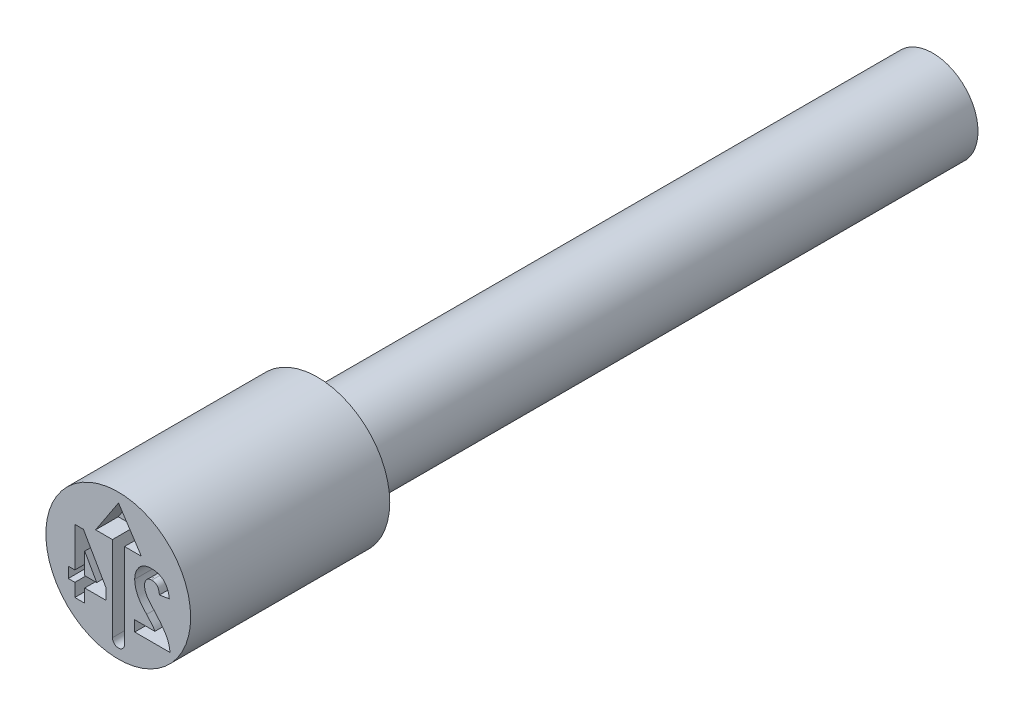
ISO-10303-21;
HEADER;
FILE_DESCRIPTION(('STEP AP214'),'2;1');
FILE_NAME('part.step','',(''),(''),'','','');
FILE_SCHEMA(('AUTOMOTIVE_DESIGN { 1 0 10303 214 1 1 1 1 }'));
ENDSEC;
DATA;
#1=APPLICATION_CONTEXT('core data for automotive mechanical design processes');
#2=APPLICATION_PROTOCOL_DEFINITION('international standard','automotive_design',2000,#1);
#3=PRODUCT_CONTEXT('',#1,'mechanical');
#4=PRODUCT('Part','Part','',(#3));
#5=PRODUCT_RELATED_PRODUCT_CATEGORY('part','',(#4));
#6=PRODUCT_DEFINITION_FORMATION('','',#4);
#7=PRODUCT_DEFINITION_CONTEXT('part definition',#1,'design');
#8=PRODUCT_DEFINITION('design','',#6,#7);
#9=PRODUCT_DEFINITION_SHAPE('','',#8);
#10=(LENGTH_UNIT() NAMED_UNIT(*) SI_UNIT(.MILLI.,.METRE.));
#11=(NAMED_UNIT(*) PLANE_ANGLE_UNIT() SI_UNIT($,.RADIAN.));
#12=(NAMED_UNIT(*) SI_UNIT($,.STERADIAN.) SOLID_ANGLE_UNIT());
#13=UNCERTAINTY_MEASURE_WITH_UNIT(LENGTH_MEASURE(1.E-05),#10,'distance_accuracy_value','');
#14=(GEOMETRIC_REPRESENTATION_CONTEXT(3) GLOBAL_UNCERTAINTY_ASSIGNED_CONTEXT((#13)) GLOBAL_UNIT_ASSIGNED_CONTEXT((#10,
#11,#12)) REPRESENTATION_CONTEXT('',''));
#15=CARTESIAN_POINT('',(0.,0.,0.));
#16=DIRECTION('',(0.,0.,1.));
#17=DIRECTION('',(1.,0.,0.));
#18=AXIS2_PLACEMENT_3D('',#15,#16,#17);
#19=CARTESIAN_POINT('',(0.,0.8,0.));
#20=DIRECTION('',(0.,0.,-1.));
#21=DIRECTION('',(-1.,0.,0.));
#22=AXIS2_PLACEMENT_3D('',#19,#20,#21);
#23=PLANE('',#22);
#24=DIRECTION('',(0.,-1.,0.));
#25=VECTOR('',#24,1.);
#26=CARTESIAN_POINT('',(0.181678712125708,-0.331818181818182,0.));
#27=LINE('',#26,#25);
#28=CARTESIAN_POINT('',(0.181678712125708,-0.331818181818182,0.));
#29=VERTEX_POINT('',#28);
#30=CARTESIAN_POINT('',(0.181678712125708,-0.45,0.));
#31=VERTEX_POINT('',#30);
#32=EDGE_CURVE('E432',#29,#31,#27,.T.);
#33=ORIENTED_EDGE('',*,*,#32,.F.);
#34=DIRECTION('',(-1.,0.,0.));
#35=VECTOR('',#34,1.);
#36=CARTESIAN_POINT('',(0.404832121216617,-0.331818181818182,0.));
#37=LINE('',#36,#35);
#38=CARTESIAN_POINT('',(0.404832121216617,-0.331818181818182,0.));
#39=VERTEX_POINT('',#38);
#40=EDGE_CURVE('E50',#39,#29,#37,.T.);
#41=ORIENTED_EDGE('',*,*,#40,.F.);
#42=CARTESIAN_POINT('',(0.313212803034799,-0.215056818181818,0.));
#43=CARTESIAN_POINT('',(0.31752311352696,-0.219837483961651,0.));
#44=CARTESIAN_POINT('',(0.325740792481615,-0.228951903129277,0.));
#45=CARTESIAN_POINT('',(0.33746199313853,-0.242003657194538,0.));
#46=CARTESIAN_POINT('',(0.347723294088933,-0.253976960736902,0.));
#47=CARTESIAN_POINT('',(0.357023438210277,-0.264436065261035,0.));
#48=CARTESIAN_POINT('',(0.364956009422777,-0.273688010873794,0.));
#49=CARTESIAN_POINT('',(0.371723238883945,-0.281617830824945,0.));
#50=CARTESIAN_POINT('',(0.377023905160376,-0.288458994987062,0.));
#51=CARTESIAN_POINT('',(0.385052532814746,-0.298453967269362,0.));
#52=CARTESIAN_POINT('',(0.394694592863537,-0.31252291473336,0.));
#53=CARTESIAN_POINT('',(0.401538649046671,-0.32554955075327,0.));
#54=CARTESIAN_POINT('',(0.404832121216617,-0.331818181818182,0.));
#55=B_SPLINE_CURVE_WITH_KNOTS('',3,(#42,#43,#44,#45,#46,#47,#48,#49,#50,#51,#52,#53,#54),
.UNSPECIFIED.,.F.,.F.,(4,1,1,1,1,1,1,1,1,1,4),(0.,0.129703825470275,0.247282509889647,
0.353458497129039,0.447427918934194,0.529283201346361,0.599034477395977,0.657443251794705,
0.703634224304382,0.857383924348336,1.),.UNSPECIFIED.);
#56=CARTESIAN_POINT('',(0.313212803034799,-0.215056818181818,0.));
#57=VERTEX_POINT('',#56);
#58=EDGE_CURVE('E277',#57,#39,#55,.T.);
#59=ORIENTED_EDGE('',*,*,#58,.F.);
#60=CARTESIAN_POINT('',(0.181678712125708,0.0553977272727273,0.));
#61=CARTESIAN_POINT('',(0.181798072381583,0.0482412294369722,0.));
#62=CARTESIAN_POINT('',(0.182035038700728,0.0340334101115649,0.));
#63=CARTESIAN_POINT('',(0.184468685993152,0.0128761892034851,0.));
#64=CARTESIAN_POINT('',(0.188063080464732,-0.00798619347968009,0.));
#65=CARTESIAN_POINT('',(0.193395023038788,-0.0285817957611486,0.));
#66=CARTESIAN_POINT('',(0.200289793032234,-0.0490153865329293,0.));
#67=CARTESIAN_POINT('',(0.208685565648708,-0.0694638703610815,0.));
#68=CARTESIAN_POINT('',(0.218633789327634,-0.0899943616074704,0.));
#69=CARTESIAN_POINT('',(0.228430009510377,-0.107005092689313,0.));
#70=CARTESIAN_POINT('',(0.237207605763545,-0.121137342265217,0.));
#71=CARTESIAN_POINT('',(0.24502378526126,-0.132433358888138,0.));
#72=CARTESIAN_POINT('',(0.253931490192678,-0.144389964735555,0.));
#73=CARTESIAN_POINT('',(0.263680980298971,-0.157208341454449,0.));
#74=CARTESIAN_POINT('',(0.274654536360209,-0.170641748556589,0.));
#75=CARTESIAN_POINT('',(0.286584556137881,-0.184850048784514,0.));
#76=CARTESIAN_POINT('',(0.299512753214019,-0.19976647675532,0.));
#77=CARTESIAN_POINT('',(0.308557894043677,-0.209861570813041,0.));
#78=CARTESIAN_POINT('',(0.313212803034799,-0.215056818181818,0.));
#79=B_SPLINE_CURVE_WITH_KNOTS('',3,(#60,#61,#62,#63,#64,#65,#66,#67,#68,#69,#70,#71,#72,#73,#74,
#75,#76,#77,#78),.UNSPECIFIED.,.F.,.F.,(4,1,1,1,1,1,1,1,1,1,1,1,1,1,1,1,4),(0.,
0.0695355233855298,0.13804910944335,0.206755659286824,0.275184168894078,0.344608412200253,
0.416231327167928,0.489922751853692,0.566190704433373,0.606927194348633,0.651609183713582,
0.699660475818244,0.751855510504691,0.80813763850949,0.868245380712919,0.932195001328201,1.),.UNSPECIFIED.);
#80=CARTESIAN_POINT('',(0.181678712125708,0.0553977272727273,0.));
#81=VERTEX_POINT('',#80);
#82=EDGE_CURVE('E280',#81,#57,#79,.T.);
#83=ORIENTED_EDGE('',*,*,#82,.F.);
#84=CARTESIAN_POINT('',(0.367900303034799,0.25,0.));
#85=CARTESIAN_POINT('',(0.360407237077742,0.249879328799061,0.));
#86=CARTESIAN_POINT('',(0.345883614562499,0.249645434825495,0.));
#87=CARTESIAN_POINT('',(0.324844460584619,0.246610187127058,0.));
#88=CARTESIAN_POINT('',(0.305145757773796,0.242285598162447,0.));
#89=CARTESIAN_POINT('',(0.286981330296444,0.235558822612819,0.));
#90=CARTESIAN_POINT('',(0.270033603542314,0.22746716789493,0.));
#91=CARTESIAN_POINT('',(0.254793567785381,0.216991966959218,0.));
#92=CARTESIAN_POINT('',(0.240636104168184,0.205119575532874,0.));
#93=CARTESIAN_POINT('',(0.228497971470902,0.191024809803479,0.));
#94=CARTESIAN_POINT('',(0.217448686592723,0.176126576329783,0.));
#95=CARTESIAN_POINT('',(0.20796161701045,0.160424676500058,0.));
#96=CARTESIAN_POINT('',(0.199747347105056,0.144335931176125,0.));
#97=CARTESIAN_POINT('',(0.193201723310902,0.127572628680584,0.));
#98=CARTESIAN_POINT('',(0.188105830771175,0.1102649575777,0.));
#99=CARTESIAN_POINT('',(0.184433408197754,0.0924497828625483,0.));
#100=CARTESIAN_POINT('',(0.182027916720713,0.0741187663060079,0.));
#101=CARTESIAN_POINT('',(0.181796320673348,0.0617027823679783,0.));
#102=CARTESIAN_POINT('',(0.181678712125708,0.0553977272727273,0.));
#103=B_SPLINE_CURVE_WITH_KNOTS('',3,(#84,#85,#86,#87,#88,#89,#90,#91,#92,#93,#94,#95,#96,#97,
#98,#99,#100,#101,#102),.UNSPECIFIED.,.F.,.F.,(4,1,1,1,1,1,1,1,1,1,1,1,1,1,1,1,4),(0.,
0.0741126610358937,0.143650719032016,0.210051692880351,0.273364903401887,0.33499527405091,
0.395446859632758,0.455947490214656,0.517372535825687,0.579059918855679,0.639431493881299,
0.698754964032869,0.757682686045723,0.817305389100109,0.877150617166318,0.937614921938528,1.),.UNSPECIFIED.);
#104=CARTESIAN_POINT('',(0.367900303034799,0.25,0.));
#105=VERTEX_POINT('',#104);
#106=EDGE_CURVE('E652',#105,#81,#103,.T.);
#107=ORIENTED_EDGE('',*,*,#106,.F.);
#108=CARTESIAN_POINT('',(0.56349689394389,0.0590909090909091,0.));
#109=CARTESIAN_POINT('',(0.562583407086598,0.067065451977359,0.));
#110=CARTESIAN_POINT('',(0.560811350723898,0.082535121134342,0.));
#111=CARTESIAN_POINT('',(0.556119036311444,0.104755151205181,0.));
#112=CARTESIAN_POINT('',(0.550561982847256,0.125408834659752,0.));
#113=CARTESIAN_POINT('',(0.543603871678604,0.144389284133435,0.));
#114=CARTESIAN_POINT('',(0.535352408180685,0.161721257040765,0.));
#115=CARTESIAN_POINT('',(0.52577963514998,0.177385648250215,0.));
#116=CARTESIAN_POINT('',(0.515161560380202,0.191646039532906,0.));
#117=CARTESIAN_POINT('',(0.50296231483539,0.204020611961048,0.));
#118=CARTESIAN_POINT('',(0.489668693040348,0.214846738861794,0.));
#119=CARTESIAN_POINT('',(0.475370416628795,0.224322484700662,0.));
#120=CARTESIAN_POINT('',(0.459962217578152,0.232245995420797,0.));
#121=CARTESIAN_POINT('',(0.443578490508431,0.238853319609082,0.));
#122=CARTESIAN_POINT('',(0.426070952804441,0.243745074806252,0.));
#123=CARTESIAN_POINT('',(0.407617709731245,0.247489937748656,0.));
#124=CARTESIAN_POINT('',(0.388072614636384,0.249602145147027,0.));
#125=CARTESIAN_POINT('',(0.37472334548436,0.249865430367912,0.));
#126=CARTESIAN_POINT('',(0.367900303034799,0.25,0.));
#127=B_SPLINE_CURVE_WITH_KNOTS('',3,(#108,#109,#110,#111,#112,#113,#114,#115,#116,#117,#118,
#119,#120,#121,#122,#123,#124,#125,#126),.UNSPECIFIED.,.F.,.F.,(4,1,1,1,1,1,1,1,1,1,1,1,1,1,1,1,
4),(0.,0.0785696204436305,0.152415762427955,0.222166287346,0.287893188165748,0.350116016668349,
0.409841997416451,0.467436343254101,0.523838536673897,0.579532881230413,0.635093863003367,
0.691507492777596,0.748942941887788,0.807798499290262,0.869275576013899,0.933184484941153,1.),.UNSPECIFIED.);
#128=CARTESIAN_POINT('',(0.56349689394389,0.0590909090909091,0.));
#129=VERTEX_POINT('',#128);
#130=EDGE_CURVE('E660',#129,#105,#127,.T.);
#131=ORIENTED_EDGE('',*,*,#130,.F.);
#132=DIRECTION('',(0.986393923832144,0.164398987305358,0.));
#133=VECTOR('',#132,1.);
#134=CARTESIAN_POINT('',(0.454405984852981,0.0409090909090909,0.));
#135=LINE('',#134,#133);
#136=CARTESIAN_POINT('',(0.454405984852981,0.0409090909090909,0.));
#137=VERTEX_POINT('',#136);
#138=EDGE_CURVE('E668',#137,#129,#135,.T.);
#139=ORIENTED_EDGE('',*,*,#138,.F.);
#140=CARTESIAN_POINT('',(0.370315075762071,0.140909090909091,0.));
#141=CARTESIAN_POINT('',(0.376457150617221,0.140640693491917,0.));
#142=CARTESIAN_POINT('',(0.388229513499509,0.140126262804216,0.));
#143=CARTESIAN_POINT('',(0.404786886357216,0.135336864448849,0.));
#144=CARTESIAN_POINT('',(0.419157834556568,0.127441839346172,0.));
#145=CARTESIAN_POINT('',(0.430934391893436,0.115983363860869,0.));
#146=CARTESIAN_POINT('',(0.440599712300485,0.101667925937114,0.));
#147=CARTESIAN_POINT('',(0.447577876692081,0.0840710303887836,0.));
#148=CARTESIAN_POINT('',(0.452362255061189,0.0635269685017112,0.));
#149=CARTESIAN_POINT('',(0.453697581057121,0.0487489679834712,0.));
#150=CARTESIAN_POINT('',(0.454405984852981,0.0409090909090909,0.));
#151=B_SPLINE_CURVE_WITH_KNOTS('',3,(#140,#141,#142,#143,#144,#145,#146,#147,#148,#149,#150),
.UNSPECIFIED.,.F.,.F.,(4,1,1,1,1,1,1,1,4),(0.,0.124990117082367,0.239565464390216,
0.348057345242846,0.455950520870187,0.571356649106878,0.697751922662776,0.839654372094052,1.),.UNSPECIFIED.);
#152=CARTESIAN_POINT('',(0.370315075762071,0.140909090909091,0.));
#153=VERTEX_POINT('',#152);
#154=EDGE_CURVE('E674',#153,#137,#151,.T.);
#155=ORIENTED_EDGE('',*,*,#154,.F.);
#156=CARTESIAN_POINT('',(0.290769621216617,0.0484375,0.));
#157=CARTESIAN_POINT('',(0.291020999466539,0.0556092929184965,0.));
#158=CARTESIAN_POINT('',(0.291496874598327,0.0691859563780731,0.));
#159=CARTESIAN_POINT('',(0.295569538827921,0.0881548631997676,0.));
#160=CARTESIAN_POINT('',(0.302378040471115,0.104467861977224,0.));
#161=CARTESIAN_POINT('',(0.312219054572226,0.117712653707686,0.));
#162=CARTESIAN_POINT('',(0.324199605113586,0.128109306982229,0.));
#163=CARTESIAN_POINT('',(0.338018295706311,0.135695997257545,0.));
#164=CARTESIAN_POINT('',(0.353657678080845,0.140190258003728,0.));
#165=CARTESIAN_POINT('',(0.364651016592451,0.140664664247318,0.));
#166=CARTESIAN_POINT('',(0.370315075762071,0.140909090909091,0.));
#167=B_SPLINE_CURVE_WITH_KNOTS('',3,(#156,#157,#158,#159,#160,#161,#162,#163,#164,#165,#166),
.UNSPECIFIED.,.F.,.F.,(4,1,1,1,1,1,1,1,4),(0.,0.155726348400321,0.294799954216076,
0.419246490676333,0.536972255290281,0.650040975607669,0.761487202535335,0.87711188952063,1.),.UNSPECIFIED.);
#168=CARTESIAN_POINT('',(0.290769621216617,0.0484375,0.));
#169=VERTEX_POINT('',#168);
#170=EDGE_CURVE('E679',#169,#153,#167,.T.);
#171=ORIENTED_EDGE('',*,*,#170,.F.);
#172=CARTESIAN_POINT('',(0.316195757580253,-0.0369318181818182,0.));
#173=CARTESIAN_POINT('',(0.312308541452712,-0.0299683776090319,0.));
#174=CARTESIAN_POINT('',(0.304720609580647,-0.0163755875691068,0.));
#175=CARTESIAN_POINT('',(0.296818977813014,0.00516459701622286,0.));
#176=CARTESIAN_POINT('',(0.291654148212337,0.0267436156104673,0.));
#177=CARTESIAN_POINT('',(0.291062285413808,0.0412596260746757,0.));
#178=CARTESIAN_POINT('',(0.290769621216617,0.0484375,0.));
#179=B_SPLINE_CURVE_WITH_KNOTS('',3,(#172,#173,#174,#175,#176,#177,#178),.UNSPECIFIED.,.F.,.F.,
(4,1,1,1,4),(0.,0.265072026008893,0.517426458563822,0.761377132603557,1.),.UNSPECIFIED.);
#180=CARTESIAN_POINT('',(0.316195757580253,-0.0369318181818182,0.));
#181=VERTEX_POINT('',#180);
#182=EDGE_CURVE('E687',#181,#169,#179,.T.);
#183=ORIENTED_EDGE('',*,*,#182,.F.);
#184=CARTESIAN_POINT('',(0.407530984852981,-0.148579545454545,0.));
#185=CARTESIAN_POINT('',(0.401643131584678,-0.142012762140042,0.));
#186=CARTESIAN_POINT('',(0.390379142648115,-0.129449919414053,0.));
#187=CARTESIAN_POINT('',(0.374535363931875,-0.111257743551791,0.));
#188=CARTESIAN_POINT('',(0.360283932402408,-0.0948985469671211,0.));
#189=CARTESIAN_POINT('',(0.348079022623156,-0.0800346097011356,0.));
#190=CARTESIAN_POINT('',(0.337490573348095,-0.0669767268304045,0.));
#191=CARTESIAN_POINT('',(0.328715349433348,-0.0555258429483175,0.));
#192=CARTESIAN_POINT('',(0.321648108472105,-0.0457812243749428,0.));
#193=CARTESIAN_POINT('',(0.317870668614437,-0.0396502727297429,0.));
#194=CARTESIAN_POINT('',(0.316195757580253,-0.0369318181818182,0.));
#195=B_SPLINE_CURVE_WITH_KNOTS('',3,(#184,#185,#186,#187,#188,#189,#190,#191,#192,#193,#194),
.UNSPECIFIED.,.F.,.F.,(4,1,1,1,1,1,1,1,4),(0.,0.183233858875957,0.350542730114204,
0.501198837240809,0.633950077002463,0.750092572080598,0.850434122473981,0.933682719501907,1.),.UNSPECIFIED.);
#196=CARTESIAN_POINT('',(0.407530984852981,-0.148579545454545,0.));
#197=VERTEX_POINT('',#196);
#198=EDGE_CURVE('E695',#197,#181,#195,.T.);
#199=ORIENTED_EDGE('',*,*,#198,.F.);
#200=CARTESIAN_POINT('',(0.572587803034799,-0.45,0.));
#201=CARTESIAN_POINT('',(0.571212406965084,-0.438360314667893,0.));
#202=CARTESIAN_POINT('',(0.568465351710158,-0.415112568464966,0.));
#203=CARTESIAN_POINT('',(0.560147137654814,-0.3809918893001,0.));
#204=CARTESIAN_POINT('',(0.548934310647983,-0.34765901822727,0.));
#205=CARTESIAN_POINT('',(0.53665622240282,-0.320516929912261,0.));
#206=CARTESIAN_POINT('',(0.524471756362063,-0.298601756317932,0.));
#207=CARTESIAN_POINT('',(0.513571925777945,-0.280720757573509,0.));
#208=CARTESIAN_POINT('',(0.500591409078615,-0.261693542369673,0.));
#209=CARTESIAN_POINT('',(0.485545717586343,-0.241545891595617,0.));
#210=CARTESIAN_POINT('',(0.46886276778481,-0.219979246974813,0.));
#211=CARTESIAN_POINT('',(0.450173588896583,-0.197219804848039,0.));
#212=CARTESIAN_POINT('',(0.429575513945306,-0.173247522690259,0.));
#213=CARTESIAN_POINT('',(0.415040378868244,-0.156982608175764,0.));
#214=CARTESIAN_POINT('',(0.407530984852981,-0.148579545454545,0.));
#215=B_SPLINE_CURVE_WITH_KNOTS('',3,(#200,#201,#202,#203,#204,#205,#206,#207,#208,#209,#210,
#211,#212,#213,#214),.UNSPECIFIED.,.F.,.F.,(4,1,1,1,1,1,1,1,1,1,1,1,4),(0.,0.100223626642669,
0.20017495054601,0.29986393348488,0.400868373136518,0.454549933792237,0.514382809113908,
0.580015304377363,0.651574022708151,0.729543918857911,0.813332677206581,0.90356068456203,1.),.UNSPECIFIED.);
#216=CARTESIAN_POINT('',(0.572587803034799,-0.45,0.));
#217=VERTEX_POINT('',#216);
#218=EDGE_CURVE('E703',#217,#197,#215,.T.);
#219=ORIENTED_EDGE('',*,*,#218,.F.);
#220=DIRECTION('',(1.,0.,0.));
#221=VECTOR('',#220,1.);
#222=CARTESIAN_POINT('',(0.181678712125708,-0.45,0.));
#223=LINE('',#222,#221);
#224=EDGE_CURVE('E711',#31,#217,#223,.T.);
#225=ORIENTED_EDGE('',*,*,#224,.F.);
#226=EDGE_LOOP('',(#33,#41,#59,#83,#107,#131,#139,#155,#171,#183,#199,#219,#225));
#227=FACE_BOUND('',#226,.T.);
#228=DIRECTION('',(0.,1.,0.));
#229=VECTOR('',#228,1.);
#230=CARTESIAN_POINT('',(-0.370684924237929,-0.45,0.));
#231=LINE('',#230,#229);
#232=CARTESIAN_POINT('',(-0.370684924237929,-0.45,0.));
#233=VERTEX_POINT('',#232);
#234=CARTESIAN_POINT('',(-0.370684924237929,-0.304545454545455,0.));
#235=VERTEX_POINT('',#234);
#236=EDGE_CURVE('E437',#233,#235,#231,.T.);
#237=ORIENTED_EDGE('',*,*,#236,.F.);
#238=DIRECTION('',(1.,0.,0.));
#239=VECTOR('',#238,1.);
#240=CARTESIAN_POINT('',(-0.479775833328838,-0.45,0.));
#241=LINE('',#240,#239);
#242=CARTESIAN_POINT('',(-0.479775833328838,-0.45,0.));
#243=VERTEX_POINT('',#242);
#244=EDGE_CURVE('E58',#243,#233,#241,.T.);
#245=ORIENTED_EDGE('',*,*,#244,.F.);
#246=DIRECTION('',(0.,-1.,0.));
#247=VECTOR('',#246,1.);
#248=CARTESIAN_POINT('',(-0.479775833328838,-0.304545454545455,0.));
#249=LINE('',#248,#247);
#250=CARTESIAN_POINT('',(-0.479775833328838,-0.304545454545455,0.));
#251=VERTEX_POINT('',#250);
#252=EDGE_CURVE('E538',#251,#243,#249,.T.);
#253=ORIENTED_EDGE('',*,*,#252,.F.);
#254=DIRECTION('',(1.,0.,0.));
#255=VECTOR('',#254,1.);
#256=CARTESIAN_POINT('',(-0.552503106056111,-0.304545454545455,0.));
#257=LINE('',#256,#255);
#258=CARTESIAN_POINT('',(-0.552503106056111,-0.304545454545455,0.));
#259=VERTEX_POINT('',#258);
#260=EDGE_CURVE('E542',#259,#251,#257,.T.);
#261=ORIENTED_EDGE('',*,*,#260,.F.);
#262=DIRECTION('',(0.,-1.,0.));
#263=VECTOR('',#262,1.);
#264=CARTESIAN_POINT('',(-0.552503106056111,-0.186363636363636,0.));
#265=LINE('',#264,#263);
#266=CARTESIAN_POINT('',(-0.552503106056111,-0.186363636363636,0.));
#267=VERTEX_POINT('',#266);
#268=EDGE_CURVE('E545',#267,#259,#265,.T.);
#269=ORIENTED_EDGE('',*,*,#268,.F.);
#270=DIRECTION('',(-1.,0.,0.));
#271=VECTOR('',#270,1.);
#272=CARTESIAN_POINT('',(-0.479775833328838,-0.186363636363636,0.));
#273=LINE('',#272,#271);
#274=CARTESIAN_POINT('',(-0.479775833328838,-0.186363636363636,0.));
#275=VERTEX_POINT('',#274);
#276=EDGE_CURVE('E548',#275,#267,#273,.T.);
#277=ORIENTED_EDGE('',*,*,#276,.F.);
#278=DIRECTION('',(0.,-1.,0.));
#279=VECTOR('',#278,1.);
#280=CARTESIAN_POINT('',(-0.479775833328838,0.25,0.));
#281=LINE('',#280,#279);
#282=CARTESIAN_POINT('',(-0.479775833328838,0.25,0.));
#283=VERTEX_POINT('',#282);
#284=EDGE_CURVE('E551',#283,#275,#281,.T.);
#285=ORIENTED_EDGE('',*,*,#284,.F.);
#286=DIRECTION('',(-1.,0.,0.));
#287=VECTOR('',#286,1.);
#288=CARTESIAN_POINT('',(-0.384889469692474,0.25,0.));
#289=LINE('',#288,#287);
#290=CARTESIAN_POINT('',(-0.384889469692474,0.25,0.));
#291=VERTEX_POINT('',#290);
#292=EDGE_CURVE('E554',#291,#283,#289,.T.);
#293=ORIENTED_EDGE('',*,*,#292,.F.);
#294=DIRECTION('',(-0.497596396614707,0.867408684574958,0.));
#295=VECTOR('',#294,1.);
#296=CARTESIAN_POINT('',(-0.134321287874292,-0.186789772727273,0.));
#297=LINE('',#296,#295);
#298=CARTESIAN_POINT('',(-0.134321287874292,-0.186789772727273,0.));
#299=VERTEX_POINT('',#298);
#300=EDGE_CURVE('E557',#299,#291,#297,.T.);
#301=ORIENTED_EDGE('',*,*,#300,.F.);
#302=DIRECTION('',(0.,1.,0.));
#303=VECTOR('',#302,1.);
#304=CARTESIAN_POINT('',(-0.134321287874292,-0.304545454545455,0.));
#305=LINE('',#304,#303);
#306=CARTESIAN_POINT('',(-0.134321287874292,-0.304545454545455,0.));
#307=VERTEX_POINT('',#306);
#308=EDGE_CURVE('E560',#307,#299,#305,.T.);
#309=ORIENTED_EDGE('',*,*,#308,.F.);
#310=DIRECTION('',(1.,0.,0.));
#311=VECTOR('',#310,1.);
#312=CARTESIAN_POINT('',(-0.370684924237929,-0.304545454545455,0.));
#313=LINE('',#312,#311);
#314=EDGE_CURVE('E563',#235,#307,#313,.T.);
#315=ORIENTED_EDGE('',*,*,#314,.F.);
#316=EDGE_LOOP('',(#237,#245,#253,#261,#269,#277,#285,#293,#301,#309,#315));
#317=FACE_BOUND('',#316,.T.);
#318=CARTESIAN_POINT('',(0.,0.,0.));
#319=DIRECTION('',(0.,0.,1.));
#320=DIRECTION('',(1.,0.,0.));
#321=AXIS2_PLACEMENT_3D('',#318,#319,#320);
#322=CIRCLE('',#321,0.8);
#323=CARTESIAN_POINT('',(0.8,0.,0.));
#324=VERTEX_POINT('',#323);
#325=EDGE_CURVE('E43',#324,#324,#322,.T.);
#326=ORIENTED_EDGE('',*,*,#325,.T.);
#327=EDGE_LOOP('',(#326));
#328=FACE_BOUND('',#327,.T.);
#329=DIRECTION('',(0.,1.,0.));
#330=VECTOR('',#329,1.);
#331=CARTESIAN_POINT('',(0.0691688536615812,0.312374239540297,0.));
#332=LINE('',#331,#330);
#333=CARTESIAN_POINT('',(0.0691688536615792,-0.626505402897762,0.));
#334=VERTEX_POINT('',#333);
#335=CARTESIAN_POINT('',(0.0691688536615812,0.312374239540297,0.));
#336=VERTEX_POINT('',#335);
#337=EDGE_CURVE('E444',#334,#336,#332,.T.);
#338=ORIENTED_EDGE('',*,*,#337,.F.);
#339=CARTESIAN_POINT('',(0.00250326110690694,-0.626505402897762,0.));
#340=DIRECTION('',(0.,0.,1.));
#341=DIRECTION('',(1.,0.,0.));
#342=AXIS2_PLACEMENT_3D('',#339,#340,#341);
#343=CIRCLE('',#342,0.0666655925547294);
#344=CARTESIAN_POINT('',(-0.0641623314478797,-0.626505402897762,0.));
#345=VERTEX_POINT('',#344);
#346=EDGE_CURVE('E446',#345,#334,#343,.T.);
#347=ORIENTED_EDGE('',*,*,#346,.F.);
#348=DIRECTION('',(0.,-1.,0.));
#349=VECTOR('',#348,1.);
#350=CARTESIAN_POINT('',(-0.0641623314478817,0.312374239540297,0.));
#351=LINE('',#350,#349);
#352=CARTESIAN_POINT('',(-0.0641623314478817,0.312374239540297,0.));
#353=VERTEX_POINT('',#352);
#354=EDGE_CURVE('E466',#353,#345,#351,.T.);
#355=ORIENTED_EDGE('',*,*,#354,.F.);
#356=DIRECTION('',(1.,0.,0.));
#357=VECTOR('',#356,1.);
#358=CARTESIAN_POINT('',(-0.250167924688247,0.312374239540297,0.));
#359=LINE('',#358,#357);
#360=CARTESIAN_POINT('',(-0.250167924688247,0.312374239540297,0.));
#361=VERTEX_POINT('',#360);
#362=EDGE_CURVE('E463',#361,#353,#359,.T.);
#363=ORIENTED_EDGE('',*,*,#362,.F.);
#364=DIRECTION('',(-0.550159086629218,-0.835059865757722,0.));
#365=VECTOR('',#364,1.);
#366=CARTESIAN_POINT('',(0.00250326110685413,0.69589161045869,0.));
#367=LINE('',#366,#365);
#368=CARTESIAN_POINT('',(0.00250326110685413,0.69589161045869,0.));
#369=VERTEX_POINT('',#368);
#370=EDGE_CURVE('E460',#369,#361,#367,.T.);
#371=ORIENTED_EDGE('',*,*,#370,.F.);
#372=DIRECTION('',(-0.550159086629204,0.835059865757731,0.));
#373=VECTOR('',#372,1.);
#374=CARTESIAN_POINT('',(0.00250326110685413,0.69589161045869,0.));
#375=LINE('',#374,#373);
#376=CARTESIAN_POINT('',(0.255174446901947,0.312374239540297,0.));
#377=VERTEX_POINT('',#376);
#378=EDGE_CURVE('E452',#377,#369,#375,.T.);
#379=ORIENTED_EDGE('',*,*,#378,.F.);
#380=DIRECTION('',(1.,0.,0.));
#381=VECTOR('',#380,1.);
#382=CARTESIAN_POINT('',(0.255174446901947,0.312374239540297,0.));
#383=LINE('',#382,#381);
#384=EDGE_CURVE('E449',#336,#377,#383,.T.);
#385=ORIENTED_EDGE('',*,*,#384,.F.);
#386=EDGE_LOOP('',(#338,#347,#355,#363,#371,#379,#385));
#387=FACE_BOUND('',#386,.T.);
#388=ADVANCED_FACE('F35',(#227,#317,#328,#387),#23,.F.);
#389=CARTESIAN_POINT('',(0.,0.499999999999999,-2.2));
#390=DIRECTION('',(0.,0.,1.));
#391=DIRECTION('',(1.,0.,0.));
#392=AXIS2_PLACEMENT_3D('',#389,#390,#391);
#393=PLANE('',#392);
#394=CARTESIAN_POINT('',(0.,0.,-2.2));
#395=DIRECTION('',(0.,0.,1.));
#396=DIRECTION('',(1.,0.,0.));
#397=AXIS2_PLACEMENT_3D('',#394,#395,#396);
#398=CIRCLE('',#397,0.8);
#399=CARTESIAN_POINT('',(0.8,0.,-2.2));
#400=VERTEX_POINT('',#399);
#401=EDGE_CURVE('E11',#400,#400,#398,.T.);
#402=ORIENTED_EDGE('',*,*,#401,.F.);
#403=EDGE_LOOP('',(#402));
#404=FACE_BOUND('',#403,.T.);
#405=CARTESIAN_POINT('',(0.,0.,-2.2));
#406=DIRECTION('',(0.,0.,1.));
#407=DIRECTION('',(1.,0.,0.));
#408=AXIS2_PLACEMENT_3D('',#405,#406,#407);
#409=CIRCLE('',#408,0.499999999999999);
#410=CARTESIAN_POINT('',(0.499999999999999,0.,-2.2));
#411=VERTEX_POINT('',#410);
#412=EDGE_CURVE('E472',#411,#411,#409,.T.);
#413=ORIENTED_EDGE('',*,*,#412,.T.);
#414=EDGE_LOOP('',(#413));
#415=FACE_BOUND('',#414,.T.);
#416=ADVANCED_FACE('F37',(#404,#415),#393,.F.);
#417=CARTESIAN_POINT('',(0.,0.,-0.403888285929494));
#418=DIRECTION('',(0.,0.,1.));
#419=DIRECTION('',(1.,0.,0.));
#420=AXIS2_PLACEMENT_3D('',#417,#418,#419);
#421=CYLINDRICAL_SURFACE('',#420,0.8);
#422=ORIENTED_EDGE('',*,*,#325,.F.);
#423=EDGE_LOOP('',(#422));
#424=FACE_BOUND('',#423,.T.);
#425=ORIENTED_EDGE('',*,*,#401,.T.);
#426=EDGE_LOOP('',(#425));
#427=FACE_BOUND('',#426,.T.);
#428=ADVANCED_FACE('F413',(#424,#427),#421,.T.);
#429=CARTESIAN_POINT('',(0.,0.,-9.));
#430=DIRECTION('',(0.,0.,1.));
#431=DIRECTION('',(1.,0.,0.));
#432=AXIS2_PLACEMENT_3D('',#429,#430,#431);
#433=PLANE('',#432);
#434=CARTESIAN_POINT('',(0.,0.,-9.));
#435=DIRECTION('',(0.,0.,1.));
#436=DIRECTION('',(1.,0.,0.));
#437=AXIS2_PLACEMENT_3D('',#434,#435,#436);
#438=CIRCLE('',#437,0.5);
#439=CARTESIAN_POINT('',(0.5,0.,-9.));
#440=VERTEX_POINT('',#439);
#441=EDGE_CURVE('E488',#440,#440,#438,.T.);
#442=ORIENTED_EDGE('',*,*,#441,.F.);
#443=EDGE_LOOP('',(#442));
#444=FACE_BOUND('',#443,.T.);
#445=ADVANCED_FACE('F409',(#444),#433,.F.);
#446=CARTESIAN_POINT('',(0.,0.,-0.403888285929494));
#447=DIRECTION('',(0.,0.,1.));
#448=DIRECTION('',(1.,0.,0.));
#449=AXIS2_PLACEMENT_3D('',#446,#447,#448);
#450=CYLINDRICAL_SURFACE('',#449,0.5);
#451=ORIENTED_EDGE('',*,*,#412,.F.);
#452=EDGE_LOOP('',(#451));
#453=FACE_BOUND('',#452,.T.);
#454=ORIENTED_EDGE('',*,*,#441,.T.);
#455=EDGE_LOOP('',(#454));
#456=FACE_BOUND('',#455,.T.);
#457=ADVANCED_FACE('F405',(#453,#456),#450,.T.);
#458=CARTESIAN_POINT('',(0.00250326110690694,-0.626505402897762,-0.25));
#459=DIRECTION('',(0.,0.,1.));
#460=DIRECTION('',(1.,0.,0.));
#461=AXIS2_PLACEMENT_3D('',#458,#459,#460);
#462=CYLINDRICAL_SURFACE('',#461,0.0666655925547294);
#463=ORIENTED_EDGE('',*,*,#346,.T.);
#464=DIRECTION('',(0.,0.,1.));
#465=VECTOR('',#464,1.);
#466=CARTESIAN_POINT('',(0.0691688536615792,-0.626505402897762,-0.25));
#467=LINE('',#466,#465);
#468=CARTESIAN_POINT('',(0.0691688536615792,-0.626505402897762,-0.25));
#469=VERTEX_POINT('',#468);
#470=EDGE_CURVE('E483',#469,#334,#467,.T.);
#471=ORIENTED_EDGE('',*,*,#470,.F.);
#472=CARTESIAN_POINT('',(0.00250326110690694,-0.626505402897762,-0.25));
#473=DIRECTION('',(0.,0.,1.));
#474=DIRECTION('',(1.,0.,0.));
#475=AXIS2_PLACEMENT_3D('',#472,#473,#474);
#476=CIRCLE('',#475,0.0666655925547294);
#477=CARTESIAN_POINT('',(-0.0641623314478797,-0.626505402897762,-0.25));
#478=VERTEX_POINT('',#477);
#479=EDGE_CURVE('E469',#478,#469,#476,.T.);
#480=ORIENTED_EDGE('',*,*,#479,.F.);
#481=DIRECTION('',(0.,0.,1.));
#482=VECTOR('',#481,1.);
#483=CARTESIAN_POINT('',(-0.0641623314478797,-0.626505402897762,-0.25));
#484=LINE('',#483,#482);
#485=EDGE_CURVE('E470',#478,#345,#484,.T.);
#486=ORIENTED_EDGE('',*,*,#485,.T.);
#487=EDGE_LOOP('',(#463,#471,#480,#486));
#488=FACE_BOUND('',#487,.T.);
#489=ADVANCED_FACE('F383',(#488),#462,.F.);
#490=CARTESIAN_POINT('',(-0.0641623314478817,0.312374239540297,-0.25));
#491=DIRECTION('',(-1.,0.,0.));
#492=DIRECTION('',(0.,-1.,0.));
#493=AXIS2_PLACEMENT_3D('',#490,#491,#492);
#494=PLANE('',#493);
#495=ORIENTED_EDGE('',*,*,#354,.T.);
#496=ORIENTED_EDGE('',*,*,#485,.F.);
#497=DIRECTION('',(0.,-1.,0.));
#498=VECTOR('',#497,1.);
#499=CARTESIAN_POINT('',(-0.0641623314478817,0.312374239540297,-0.25));
#500=LINE('',#499,#498);
#501=CARTESIAN_POINT('',(-0.0641623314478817,0.312374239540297,-0.25));
#502=VERTEX_POINT('',#501);
#503=EDGE_CURVE('E485',#502,#478,#500,.T.);
#504=ORIENTED_EDGE('',*,*,#503,.F.);
#505=DIRECTION('',(0.,0.,1.));
#506=VECTOR('',#505,1.);
#507=CARTESIAN_POINT('',(-0.0641623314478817,0.312374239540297,-0.25));
#508=LINE('',#507,#506);
#509=EDGE_CURVE('E473',#502,#353,#508,.T.);
#510=ORIENTED_EDGE('',*,*,#509,.T.);
#511=EDGE_LOOP('',(#495,#496,#504,#510));
#512=FACE_BOUND('',#511,.T.);
#513=ADVANCED_FACE('F379',(#512),#494,.F.);
#514=CARTESIAN_POINT('',(-0.250167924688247,0.312374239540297,-0.25));
#515=DIRECTION('',(0.,-1.,0.));
#516=DIRECTION('',(0.,0.,-1.));
#517=AXIS2_PLACEMENT_3D('',#514,#515,#516);
#518=PLANE('',#517);
#519=ORIENTED_EDGE('',*,*,#362,.T.);
#520=ORIENTED_EDGE('',*,*,#509,.F.);
#521=DIRECTION('',(1.,0.,0.));
#522=VECTOR('',#521,1.);
#523=CARTESIAN_POINT('',(-0.250167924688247,0.312374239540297,-0.25));
#524=LINE('',#523,#522);
#525=CARTESIAN_POINT('',(-0.250167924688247,0.312374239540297,-0.25));
#526=VERTEX_POINT('',#525);
#527=EDGE_CURVE('E496',#526,#502,#524,.T.);
#528=ORIENTED_EDGE('',*,*,#527,.F.);
#529=DIRECTION('',(0.,0.,1.));
#530=VECTOR('',#529,1.);
#531=CARTESIAN_POINT('',(-0.250167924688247,0.312374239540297,-0.25));
#532=LINE('',#531,#530);
#533=EDGE_CURVE('E475',#526,#361,#532,.T.);
#534=ORIENTED_EDGE('',*,*,#533,.T.);
#535=EDGE_LOOP('',(#519,#520,#528,#534));
#536=FACE_BOUND('',#535,.T.);
#537=ADVANCED_FACE('F382',(#536),#518,.F.);
#538=CARTESIAN_POINT('',(0.00250326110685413,0.69589161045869,-0.25));
#539=DIRECTION('',(-0.835059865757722,0.550159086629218,0.));
#540=DIRECTION('',(-0.550159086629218,-0.835059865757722,0.));
#541=AXIS2_PLACEMENT_3D('',#538,#539,#540);
#542=PLANE('',#541);
#543=ORIENTED_EDGE('',*,*,#370,.T.);
#544=ORIENTED_EDGE('',*,*,#533,.F.);
#545=DIRECTION('',(-0.550159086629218,-0.835059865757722,0.));
#546=VECTOR('',#545,1.);
#547=CARTESIAN_POINT('',(0.00250326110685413,0.69589161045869,-0.25));
#548=LINE('',#547,#546);
#549=CARTESIAN_POINT('',(0.00250326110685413,0.69589161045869,-0.25));
#550=VERTEX_POINT('',#549);
#551=EDGE_CURVE('E500',#550,#526,#548,.T.);
#552=ORIENTED_EDGE('',*,*,#551,.F.);
#553=DIRECTION('',(0.,0.,1.));
#554=VECTOR('',#553,1.);
#555=CARTESIAN_POINT('',(0.00250326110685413,0.69589161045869,-0.25));
#556=LINE('',#555,#554);
#557=EDGE_CURVE('E477',#550,#369,#556,.T.);
#558=ORIENTED_EDGE('',*,*,#557,.T.);
#559=EDGE_LOOP('',(#543,#544,#552,#558));
#560=FACE_BOUND('',#559,.T.);
#561=ADVANCED_FACE('F387',(#560),#542,.F.);
#562=CARTESIAN_POINT('',(0.00250326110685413,0.69589161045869,-0.25));
#563=DIRECTION('',(0.835059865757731,0.550159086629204,0.));
#564=DIRECTION('',(-0.550159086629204,0.835059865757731,0.));
#565=AXIS2_PLACEMENT_3D('',#562,#563,#564);
#566=PLANE('',#565);
#567=ORIENTED_EDGE('',*,*,#378,.T.);
#568=ORIENTED_EDGE('',*,*,#557,.F.);
#569=DIRECTION('',(-0.550159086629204,0.835059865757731,0.));
#570=VECTOR('',#569,1.);
#571=CARTESIAN_POINT('',(0.00250326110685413,0.69589161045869,-0.25));
#572=LINE('',#571,#570);
#573=CARTESIAN_POINT('',(0.255174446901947,0.312374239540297,-0.25));
#574=VERTEX_POINT('',#573);
#575=EDGE_CURVE('E505',#574,#550,#572,.T.);
#576=ORIENTED_EDGE('',*,*,#575,.F.);
#577=DIRECTION('',(0.,0.,1.));
#578=VECTOR('',#577,1.);
#579=CARTESIAN_POINT('',(0.255174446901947,0.312374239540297,-0.25));
#580=LINE('',#579,#578);
#581=EDGE_CURVE('E479',#574,#377,#580,.T.);
#582=ORIENTED_EDGE('',*,*,#581,.T.);
#583=EDGE_LOOP('',(#567,#568,#576,#582));
#584=FACE_BOUND('',#583,.T.);
#585=ADVANCED_FACE('F391',(#584),#566,.F.);
#586=CARTESIAN_POINT('',(0.255174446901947,0.312374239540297,-0.25));
#587=DIRECTION('',(0.,-1.,0.));
#588=DIRECTION('',(0.,0.,-1.));
#589=AXIS2_PLACEMENT_3D('',#586,#587,#588);
#590=PLANE('',#589);
#591=ORIENTED_EDGE('',*,*,#384,.T.);
#592=ORIENTED_EDGE('',*,*,#581,.F.);
#593=DIRECTION('',(1.,0.,0.));
#594=VECTOR('',#593,1.);
#595=CARTESIAN_POINT('',(0.255174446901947,0.312374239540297,-0.25));
#596=LINE('',#595,#594);
#597=CARTESIAN_POINT('',(0.0691688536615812,0.312374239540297,-0.25));
#598=VERTEX_POINT('',#597);
#599=EDGE_CURVE('E508',#598,#574,#596,.T.);
#600=ORIENTED_EDGE('',*,*,#599,.F.);
#601=DIRECTION('',(0.,0.,1.));
#602=VECTOR('',#601,1.);
#603=CARTESIAN_POINT('',(0.0691688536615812,0.312374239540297,-0.25));
#604=LINE('',#603,#602);
#605=EDGE_CURVE('E481',#598,#336,#604,.T.);
#606=ORIENTED_EDGE('',*,*,#605,.T.);
#607=EDGE_LOOP('',(#591,#592,#600,#606));
#608=FACE_BOUND('',#607,.T.);
#609=ADVANCED_FACE('F395',(#608),#590,.F.);
#610=CARTESIAN_POINT('',(0.0691688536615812,0.312374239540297,-0.25));
#611=DIRECTION('',(1.,0.,0.));
#612=DIRECTION('',(0.,1.,0.));
#613=AXIS2_PLACEMENT_3D('',#610,#611,#612);
#614=PLANE('',#613);
#615=ORIENTED_EDGE('',*,*,#337,.T.);
#616=ORIENTED_EDGE('',*,*,#605,.F.);
#617=DIRECTION('',(0.,1.,0.));
#618=VECTOR('',#617,1.);
#619=CARTESIAN_POINT('',(0.0691688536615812,0.312374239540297,-0.25));
#620=LINE('',#619,#618);
#621=EDGE_CURVE('E511',#469,#598,#620,.T.);
#622=ORIENTED_EDGE('',*,*,#621,.F.);
#623=ORIENTED_EDGE('',*,*,#470,.T.);
#624=EDGE_LOOP('',(#615,#616,#622,#623));
#625=FACE_BOUND('',#624,.T.);
#626=ADVANCED_FACE('F377',(#625),#614,.F.);
#627=CARTESIAN_POINT('',(0.00250326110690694,-0.626505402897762,-0.25));
#628=DIRECTION('',(0.,0.,1.));
#629=DIRECTION('',(1.,0.,0.));
#630=AXIS2_PLACEMENT_3D('',#627,#628,#629);
#631=PLANE('',#630);
#632=ORIENTED_EDGE('',*,*,#479,.T.);
#633=ORIENTED_EDGE('',*,*,#621,.T.);
#634=ORIENTED_EDGE('',*,*,#599,.T.);
#635=ORIENTED_EDGE('',*,*,#575,.T.);
#636=ORIENTED_EDGE('',*,*,#551,.T.);
#637=ORIENTED_EDGE('',*,*,#527,.T.);
#638=ORIENTED_EDGE('',*,*,#503,.T.);
#639=EDGE_LOOP('',(#632,#633,#634,#635,#636,#637,#638));
#640=FACE_BOUND('',#639,.T.);
#641=ADVANCED_FACE('F332',(#640),#631,.T.);
#642=CARTESIAN_POINT('',(0.,0.,-0.25));
#643=DIRECTION('',(0.,0.,1.));
#644=DIRECTION('',(1.,0.,0.));
#645=AXIS2_PLACEMENT_3D('',#642,#643,#644);
#646=PLANE('',#645);
#647=DIRECTION('',(1.,0.,0.));
#648=VECTOR('',#647,1.);
#649=CARTESIAN_POINT('',(-0.479775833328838,-0.45,-0.25));
#650=LINE('',#649,#648);
#651=CARTESIAN_POINT('',(-0.479775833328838,-0.45,-0.25));
#652=VERTEX_POINT('',#651);
#653=CARTESIAN_POINT('',(-0.370684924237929,-0.45,-0.25));
#654=VERTEX_POINT('',#653);
#655=EDGE_CURVE('E541',#652,#654,#650,.T.);
#656=ORIENTED_EDGE('',*,*,#655,.T.);
#657=DIRECTION('',(0.,1.,0.));
#658=VECTOR('',#657,1.);
#659=CARTESIAN_POINT('',(-0.370684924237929,-0.45,-0.25));
#660=LINE('',#659,#658);
#661=CARTESIAN_POINT('',(-0.370684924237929,-0.304545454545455,-0.25));
#662=VERTEX_POINT('',#661);
#663=EDGE_CURVE('E595',#654,#662,#660,.T.);
#664=ORIENTED_EDGE('',*,*,#663,.T.);
#665=DIRECTION('',(1.,0.,0.));
#666=VECTOR('',#665,1.);
#667=CARTESIAN_POINT('',(-0.370684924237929,-0.304545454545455,-0.25));
#668=LINE('',#667,#666);
#669=CARTESIAN_POINT('',(-0.134321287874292,-0.304545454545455,-0.25));
#670=VERTEX_POINT('',#669);
#671=EDGE_CURVE('E592',#662,#670,#668,.T.);
#672=ORIENTED_EDGE('',*,*,#671,.T.);
#673=DIRECTION('',(0.,1.,0.));
#674=VECTOR('',#673,1.);
#675=CARTESIAN_POINT('',(-0.134321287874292,-0.304545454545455,-0.25));
#676=LINE('',#675,#674);
#677=CARTESIAN_POINT('',(-0.134321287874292,-0.186789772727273,-0.25));
#678=VERTEX_POINT('',#677);
#679=EDGE_CURVE('E589',#670,#678,#676,.T.);
#680=ORIENTED_EDGE('',*,*,#679,.T.);
#681=DIRECTION('',(-0.497596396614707,0.867408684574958,0.));
#682=VECTOR('',#681,1.);
#683=CARTESIAN_POINT('',(-0.134321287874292,-0.186789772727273,-0.25));
#684=LINE('',#683,#682);
#685=CARTESIAN_POINT('',(-0.384889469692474,0.25,-0.25));
#686=VERTEX_POINT('',#685);
#687=EDGE_CURVE('E586',#678,#686,#684,.T.);
#688=ORIENTED_EDGE('',*,*,#687,.T.);
#689=DIRECTION('',(-1.,0.,0.));
#690=VECTOR('',#689,1.);
#691=CARTESIAN_POINT('',(-0.384889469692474,0.25,-0.25));
#692=LINE('',#691,#690);
#693=CARTESIAN_POINT('',(-0.479775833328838,0.25,-0.25));
#694=VERTEX_POINT('',#693);
#695=EDGE_CURVE('E583',#686,#694,#692,.T.);
#696=ORIENTED_EDGE('',*,*,#695,.T.);
#697=DIRECTION('',(0.,-1.,0.));
#698=VECTOR('',#697,1.);
#699=CARTESIAN_POINT('',(-0.479775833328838,0.25,-0.25));
#700=LINE('',#699,#698);
#701=CARTESIAN_POINT('',(-0.479775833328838,-0.186363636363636,-0.25));
#702=VERTEX_POINT('',#701);
#703=EDGE_CURVE('E580',#694,#702,#700,.T.);
#704=ORIENTED_EDGE('',*,*,#703,.T.);
#705=DIRECTION('',(-1.,0.,0.));
#706=VECTOR('',#705,1.);
#707=CARTESIAN_POINT('',(-0.479775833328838,-0.186363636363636,-0.25));
#708=LINE('',#707,#706);
#709=CARTESIAN_POINT('',(-0.552503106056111,-0.186363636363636,-0.25));
#710=VERTEX_POINT('',#709);
#711=EDGE_CURVE('E577',#702,#710,#708,.T.);
#712=ORIENTED_EDGE('',*,*,#711,.T.);
#713=DIRECTION('',(0.,-1.,0.));
#714=VECTOR('',#713,1.);
#715=CARTESIAN_POINT('',(-0.552503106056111,-0.186363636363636,-0.25));
#716=LINE('',#715,#714);
#717=CARTESIAN_POINT('',(-0.552503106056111,-0.304545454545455,-0.25));
#718=VERTEX_POINT('',#717);
#719=EDGE_CURVE('E574',#710,#718,#716,.T.);
#720=ORIENTED_EDGE('',*,*,#719,.T.);
#721=DIRECTION('',(1.,0.,0.));
#722=VECTOR('',#721,1.);
#723=CARTESIAN_POINT('',(-0.552503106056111,-0.304545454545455,-0.25));
#724=LINE('',#723,#722);
#725=CARTESIAN_POINT('',(-0.479775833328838,-0.304545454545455,-0.25));
#726=VERTEX_POINT('',#725);
#727=EDGE_CURVE('E571',#718,#726,#724,.T.);
#728=ORIENTED_EDGE('',*,*,#727,.T.);
#729=DIRECTION('',(0.,-1.,0.));
#730=VECTOR('',#729,1.);
#731=CARTESIAN_POINT('',(-0.479775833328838,-0.304545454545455,-0.25));
#732=LINE('',#731,#730);
#733=EDGE_CURVE('E518',#726,#652,#732,.T.);
#734=ORIENTED_EDGE('',*,*,#733,.T.);
#735=EDGE_LOOP('',(#656,#664,#672,#680,#688,#696,#704,#712,#720,#728,#734));
#736=FACE_BOUND('',#735,.T.);
#737=DIRECTION('',(-1.,0.,0.));
#738=VECTOR('',#737,1.);
#739=CARTESIAN_POINT('',(-0.238156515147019,-0.186363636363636,-0.25));
#740=LINE('',#739,#738);
#741=CARTESIAN_POINT('',(-0.238156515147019,-0.186363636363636,-0.25));
#742=VERTEX_POINT('',#741);
#743=CARTESIAN_POINT('',(-0.370684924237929,-0.186363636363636,-0.25));
#744=VERTEX_POINT('',#743);
#745=EDGE_CURVE('E610',#742,#744,#740,.T.);
#746=ORIENTED_EDGE('',*,*,#745,.T.);
#747=DIRECTION('',(0.,1.,0.));
#748=VECTOR('',#747,1.);
#749=CARTESIAN_POINT('',(-0.370684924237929,-0.186363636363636,-0.25));
#750=LINE('',#749,#748);
#751=CARTESIAN_POINT('',(-0.370684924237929,0.0487215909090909,-0.25));
#752=VERTEX_POINT('',#751);
#753=EDGE_CURVE('E617',#744,#752,#750,.T.);
#754=ORIENTED_EDGE('',*,*,#753,.T.);
#755=DIRECTION('',(0.491085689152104,-0.871111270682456,0.));
#756=VECTOR('',#755,1.);
#757=CARTESIAN_POINT('',(-0.370684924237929,0.0487215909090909,-0.25));
#758=LINE('',#757,#756);
#759=EDGE_CURVE('E606',#752,#742,#758,.T.);
#760=ORIENTED_EDGE('',*,*,#759,.T.);
#761=EDGE_LOOP('',(#746,#754,#760));
#762=FACE_BOUND('',#761,.T.);
#763=ADVANCED_FACE('F328',(#736,#762),#646,.T.);
#764=CARTESIAN_POINT('',(-0.479775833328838,-0.45,-0.25));
#765=DIRECTION('',(0.,-1.,0.));
#766=DIRECTION('',(0.,0.,-1.));
#767=AXIS2_PLACEMENT_3D('',#764,#765,#766);
#768=PLANE('',#767);
#769=ORIENTED_EDGE('',*,*,#244,.T.);
#770=DIRECTION('',(0.,0.,1.));
#771=VECTOR('',#770,1.);
#772=CARTESIAN_POINT('',(-0.370684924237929,-0.45,-0.25));
#773=LINE('',#772,#771);
#774=EDGE_CURVE('E515',#654,#233,#773,.T.);
#775=ORIENTED_EDGE('',*,*,#774,.F.);
#776=ORIENTED_EDGE('',*,*,#655,.F.);
#777=DIRECTION('',(0.,0.,1.));
#778=VECTOR('',#777,1.);
#779=CARTESIAN_POINT('',(-0.479775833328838,-0.45,-0.25));
#780=LINE('',#779,#778);
#781=EDGE_CURVE('E536',#652,#243,#780,.T.);
#782=ORIENTED_EDGE('',*,*,#781,.T.);
#783=EDGE_LOOP('',(#769,#775,#776,#782));
#784=FACE_BOUND('',#783,.T.);
#785=ADVANCED_FACE('F331',(#784),#768,.F.);
#786=CARTESIAN_POINT('',(-0.479775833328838,-0.304545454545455,-0.25));
#787=DIRECTION('',(-1.,0.,0.));
#788=DIRECTION('',(0.,0.,1.));
#789=AXIS2_PLACEMENT_3D('',#786,#787,#788);
#790=PLANE('',#789);
#791=ORIENTED_EDGE('',*,*,#252,.T.);
#792=ORIENTED_EDGE('',*,*,#781,.F.);
#793=ORIENTED_EDGE('',*,*,#733,.F.);
#794=DIRECTION('',(0.,0.,1.));
#795=VECTOR('',#794,1.);
#796=CARTESIAN_POINT('',(-0.479775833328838,-0.304545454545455,-0.25));
#797=LINE('',#796,#795);
#798=EDGE_CURVE('E534',#726,#251,#797,.T.);
#799=ORIENTED_EDGE('',*,*,#798,.T.);
#800=EDGE_LOOP('',(#791,#792,#793,#799));
#801=FACE_BOUND('',#800,.T.);
#802=ADVANCED_FACE('F334',(#801),#790,.F.);
#803=CARTESIAN_POINT('',(-0.552503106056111,-0.304545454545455,-0.25));
#804=DIRECTION('',(0.,-1.,0.));
#805=DIRECTION('',(0.,0.,-1.));
#806=AXIS2_PLACEMENT_3D('',#803,#804,#805);
#807=PLANE('',#806);
#808=ORIENTED_EDGE('',*,*,#260,.T.);
#809=ORIENTED_EDGE('',*,*,#798,.F.);
#810=ORIENTED_EDGE('',*,*,#727,.F.);
#811=DIRECTION('',(0.,0.,1.));
#812=VECTOR('',#811,1.);
#813=CARTESIAN_POINT('',(-0.552503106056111,-0.304545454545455,-0.25));
#814=LINE('',#813,#812);
#815=EDGE_CURVE('E532',#718,#259,#814,.T.);
#816=ORIENTED_EDGE('',*,*,#815,.T.);
#817=EDGE_LOOP('',(#808,#809,#810,#816));
#818=FACE_BOUND('',#817,.T.);
#819=ADVANCED_FACE('F337',(#818),#807,.F.);
#820=CARTESIAN_POINT('',(-0.552503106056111,-0.186363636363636,-0.25));
#821=DIRECTION('',(-1.,0.,0.));
#822=DIRECTION('',(0.,0.,1.));
#823=AXIS2_PLACEMENT_3D('',#820,#821,#822);
#824=PLANE('',#823);
#825=ORIENTED_EDGE('',*,*,#268,.T.);
#826=ORIENTED_EDGE('',*,*,#815,.F.);
#827=ORIENTED_EDGE('',*,*,#719,.F.);
#828=DIRECTION('',(0.,0.,1.));
#829=VECTOR('',#828,1.);
#830=CARTESIAN_POINT('',(-0.552503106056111,-0.186363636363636,-0.25));
#831=LINE('',#830,#829);
#832=EDGE_CURVE('E530',#710,#267,#831,.T.);
#833=ORIENTED_EDGE('',*,*,#832,.T.);
#834=EDGE_LOOP('',(#825,#826,#827,#833));
#835=FACE_BOUND('',#834,.T.);
#836=ADVANCED_FACE('F341',(#835),#824,.F.);
#837=CARTESIAN_POINT('',(-0.479775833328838,-0.186363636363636,-0.25));
#838=DIRECTION('',(0.,1.,0.));
#839=DIRECTION('',(0.,0.,1.));
#840=AXIS2_PLACEMENT_3D('',#837,#838,#839);
#841=PLANE('',#840);
#842=ORIENTED_EDGE('',*,*,#276,.T.);
#843=ORIENTED_EDGE('',*,*,#832,.F.);
#844=ORIENTED_EDGE('',*,*,#711,.F.);
#845=DIRECTION('',(0.,0.,1.));
#846=VECTOR('',#845,1.);
#847=CARTESIAN_POINT('',(-0.479775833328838,-0.186363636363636,-0.25));
#848=LINE('',#847,#846);
#849=EDGE_CURVE('E528',#702,#275,#848,.T.);
#850=ORIENTED_EDGE('',*,*,#849,.T.);
#851=EDGE_LOOP('',(#842,#843,#844,#850));
#852=FACE_BOUND('',#851,.T.);
#853=ADVANCED_FACE('F345',(#852),#841,.F.);
#854=CARTESIAN_POINT('',(-0.479775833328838,0.25,-0.25));
#855=DIRECTION('',(-1.,0.,0.));
#856=DIRECTION('',(0.,0.,1.));
#857=AXIS2_PLACEMENT_3D('',#854,#855,#856);
#858=PLANE('',#857);
#859=ORIENTED_EDGE('',*,*,#284,.T.);
#860=ORIENTED_EDGE('',*,*,#849,.F.);
#861=ORIENTED_EDGE('',*,*,#703,.F.);
#862=DIRECTION('',(0.,0.,1.));
#863=VECTOR('',#862,1.);
#864=CARTESIAN_POINT('',(-0.479775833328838,0.25,-0.25));
#865=LINE('',#864,#863);
#866=EDGE_CURVE('E526',#694,#283,#865,.T.);
#867=ORIENTED_EDGE('',*,*,#866,.T.);
#868=EDGE_LOOP('',(#859,#860,#861,#867));
#869=FACE_BOUND('',#868,.T.);
#870=ADVANCED_FACE('F349',(#869),#858,.F.);
#871=CARTESIAN_POINT('',(-0.384889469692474,0.25,-0.25));
#872=DIRECTION('',(0.,1.,0.));
#873=DIRECTION('',(0.,0.,1.));
#874=AXIS2_PLACEMENT_3D('',#871,#872,#873);
#875=PLANE('',#874);
#876=ORIENTED_EDGE('',*,*,#292,.T.);
#877=ORIENTED_EDGE('',*,*,#866,.F.);
#878=ORIENTED_EDGE('',*,*,#695,.F.);
#879=DIRECTION('',(0.,0.,1.));
#880=VECTOR('',#879,1.);
#881=CARTESIAN_POINT('',(-0.384889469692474,0.25,-0.25));
#882=LINE('',#881,#880);
#883=EDGE_CURVE('E524',#686,#291,#882,.T.);
#884=ORIENTED_EDGE('',*,*,#883,.T.);
#885=EDGE_LOOP('',(#876,#877,#878,#884));
#886=FACE_BOUND('',#885,.T.);
#887=ADVANCED_FACE('F353',(#886),#875,.F.);
#888=CARTESIAN_POINT('',(-0.134321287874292,-0.186789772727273,-0.25));
#889=DIRECTION('',(0.867408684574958,0.497596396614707,0.));
#890=DIRECTION('',(-0.497596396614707,0.867408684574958,0.));
#891=AXIS2_PLACEMENT_3D('',#888,#889,#890);
#892=PLANE('',#891);
#893=ORIENTED_EDGE('',*,*,#300,.T.);
#894=ORIENTED_EDGE('',*,*,#883,.F.);
#895=ORIENTED_EDGE('',*,*,#687,.F.);
#896=DIRECTION('',(0.,0.,1.));
#897=VECTOR('',#896,1.);
#898=CARTESIAN_POINT('',(-0.134321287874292,-0.186789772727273,-0.25));
#899=LINE('',#898,#897);
#900=EDGE_CURVE('E522',#678,#299,#899,.T.);
#901=ORIENTED_EDGE('',*,*,#900,.T.);
#902=EDGE_LOOP('',(#893,#894,#895,#901));
#903=FACE_BOUND('',#902,.T.);
#904=ADVANCED_FACE('F357',(#903),#892,.F.);
#905=CARTESIAN_POINT('',(-0.134321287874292,-0.304545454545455,-0.25));
#906=DIRECTION('',(1.,0.,0.));
#907=DIRECTION('',(0.,0.,-1.));
#908=AXIS2_PLACEMENT_3D('',#905,#906,#907);
#909=PLANE('',#908);
#910=ORIENTED_EDGE('',*,*,#308,.T.);
#911=ORIENTED_EDGE('',*,*,#900,.F.);
#912=ORIENTED_EDGE('',*,*,#679,.F.);
#913=DIRECTION('',(0.,0.,1.));
#914=VECTOR('',#913,1.);
#915=CARTESIAN_POINT('',(-0.134321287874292,-0.304545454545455,-0.25));
#916=LINE('',#915,#914);
#917=EDGE_CURVE('E520',#670,#307,#916,.T.);
#918=ORIENTED_EDGE('',*,*,#917,.T.);
#919=EDGE_LOOP('',(#910,#911,#912,#918));
#920=FACE_BOUND('',#919,.T.);
#921=ADVANCED_FACE('F361',(#920),#909,.F.);
#922=CARTESIAN_POINT('',(-0.370684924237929,-0.304545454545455,-0.25));
#923=DIRECTION('',(0.,-1.,0.));
#924=DIRECTION('',(0.,0.,-1.));
#925=AXIS2_PLACEMENT_3D('',#922,#923,#924);
#926=PLANE('',#925);
#927=ORIENTED_EDGE('',*,*,#314,.T.);
#928=ORIENTED_EDGE('',*,*,#917,.F.);
#929=ORIENTED_EDGE('',*,*,#671,.F.);
#930=DIRECTION('',(0.,0.,1.));
#931=VECTOR('',#930,1.);
#932=CARTESIAN_POINT('',(-0.370684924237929,-0.304545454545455,-0.25));
#933=LINE('',#932,#931);
#934=EDGE_CURVE('E517',#662,#235,#933,.T.);
#935=ORIENTED_EDGE('',*,*,#934,.T.);
#936=EDGE_LOOP('',(#927,#928,#929,#935));
#937=FACE_BOUND('',#936,.T.);
#938=ADVANCED_FACE('F365',(#937),#926,.F.);
#939=CARTESIAN_POINT('',(-0.370684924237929,-0.45,-0.25));
#940=DIRECTION('',(1.,0.,0.));
#941=DIRECTION('',(0.,0.,-1.));
#942=AXIS2_PLACEMENT_3D('',#939,#940,#941);
#943=PLANE('',#942);
#944=ORIENTED_EDGE('',*,*,#236,.T.);
#945=ORIENTED_EDGE('',*,*,#934,.F.);
#946=ORIENTED_EDGE('',*,*,#663,.F.);
#947=ORIENTED_EDGE('',*,*,#774,.T.);
#948=EDGE_LOOP('',(#944,#945,#946,#947));
#949=FACE_BOUND('',#948,.T.);
#950=ADVANCED_FACE('F326',(#949),#943,.F.);
#951=CARTESIAN_POINT('',(-0.238156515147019,-0.186363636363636,-0.25));
#952=DIRECTION('',(0.,1.,0.));
#953=DIRECTION('',(0.,0.,1.));
#954=AXIS2_PLACEMENT_3D('',#951,#952,#953);
#955=PLANE('',#954);
#956=DIRECTION('',(-1.,0.,0.));
#957=VECTOR('',#956,1.);
#958=CARTESIAN_POINT('',(-0.238156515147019,-0.186363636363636,0.));
#959=LINE('',#958,#957);
#960=CARTESIAN_POINT('',(-0.238156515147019,-0.186363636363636,0.));
#961=VERTEX_POINT('',#960);
#962=CARTESIAN_POINT('',(-0.370684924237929,-0.186363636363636,0.));
#963=VERTEX_POINT('',#962);
#964=EDGE_CURVE('E613',#961,#963,#959,.T.);
#965=ORIENTED_EDGE('',*,*,#964,.T.);
#966=DIRECTION('',(0.,0.,1.));
#967=VECTOR('',#966,1.);
#968=CARTESIAN_POINT('',(-0.370684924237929,-0.186363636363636,-0.25));
#969=LINE('',#968,#967);
#970=EDGE_CURVE('E568',#744,#963,#969,.T.);
#971=ORIENTED_EDGE('',*,*,#970,.F.);
#972=ORIENTED_EDGE('',*,*,#745,.F.);
#973=DIRECTION('',(0.,0.,1.));
#974=VECTOR('',#973,1.);
#975=CARTESIAN_POINT('',(-0.238156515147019,-0.186363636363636,-0.25));
#976=LINE('',#975,#974);
#977=EDGE_CURVE('E604',#742,#961,#976,.T.);
#978=ORIENTED_EDGE('',*,*,#977,.T.);
#979=EDGE_LOOP('',(#965,#971,#972,#978));
#980=FACE_BOUND('',#979,.T.);
#981=ADVANCED_FACE('F322',(#980),#955,.F.);
#982=CARTESIAN_POINT('',(-0.370684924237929,-0.186363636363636,-0.25));
#983=DIRECTION('',(1.,0.,0.));
#984=DIRECTION('',(0.,0.,-1.));
#985=AXIS2_PLACEMENT_3D('',#982,#983,#984);
#986=PLANE('',#985);
#987=DIRECTION('',(0.,1.,0.));
#988=VECTOR('',#987,1.);
#989=CARTESIAN_POINT('',(-0.370684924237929,-0.186363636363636,0.));
#990=LINE('',#989,#988);
#991=CARTESIAN_POINT('',(-0.370684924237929,0.0487215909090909,0.));
#992=VERTEX_POINT('',#991);
#993=EDGE_CURVE('E611',#963,#992,#990,.T.);
#994=ORIENTED_EDGE('',*,*,#993,.T.);
#995=DIRECTION('',(0.,0.,1.));
#996=VECTOR('',#995,1.);
#997=CARTESIAN_POINT('',(-0.370684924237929,0.0487215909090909,-0.25));
#998=LINE('',#997,#996);
#999=EDGE_CURVE('E601',#752,#992,#998,.T.);
#1000=ORIENTED_EDGE('',*,*,#999,.F.);
#1001=ORIENTED_EDGE('',*,*,#753,.F.);
#1002=ORIENTED_EDGE('',*,*,#970,.T.);
#1003=EDGE_LOOP('',(#994,#1000,#1001,#1002));
#1004=FACE_BOUND('',#1003,.T.);
#1005=ADVANCED_FACE('F318',(#1004),#986,.F.);
#1006=CARTESIAN_POINT('',(-0.370684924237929,0.0487215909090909,-0.25));
#1007=DIRECTION('',(-0.871111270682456,-0.491085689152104,0.));
#1008=DIRECTION('',(0.491085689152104,-0.871111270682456,0.));
#1009=AXIS2_PLACEMENT_3D('',#1006,#1007,#1008);
#1010=PLANE('',#1009);
#1011=DIRECTION('',(0.491085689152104,-0.871111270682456,0.));
#1012=VECTOR('',#1011,1.);
#1013=CARTESIAN_POINT('',(-0.370684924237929,0.0487215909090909,0.));
#1014=LINE('',#1013,#1012);
#1015=EDGE_CURVE('E607',#992,#961,#1014,.T.);
#1016=ORIENTED_EDGE('',*,*,#1015,.T.);
#1017=ORIENTED_EDGE('',*,*,#977,.F.);
#1018=ORIENTED_EDGE('',*,*,#759,.F.);
#1019=ORIENTED_EDGE('',*,*,#999,.T.);
#1020=EDGE_LOOP('',(#1016,#1017,#1018,#1019));
#1021=FACE_BOUND('',#1020,.T.);
#1022=ADVANCED_FACE('F315',(#1021),#1010,.F.);
#1023=CARTESIAN_POINT('',(0.404832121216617,-0.331818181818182,-0.25));
#1024=DIRECTION('',(0.,1.,0.));
#1025=DIRECTION('',(0.,0.,1.));
#1026=AXIS2_PLACEMENT_3D('',#1023,#1024,#1025);
#1027=PLANE('',#1026);
#1028=ORIENTED_EDGE('',*,*,#40,.T.);
#1029=DIRECTION('',(0.,0.,1.));
#1030=VECTOR('',#1029,1.);
#1031=CARTESIAN_POINT('',(0.181678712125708,-0.331818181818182,-0.25));
#1032=LINE('',#1031,#1030);
#1033=CARTESIAN_POINT('',(0.181678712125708,-0.331818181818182,-0.25));
#1034=VERTEX_POINT('',#1033);
#1035=EDGE_CURVE('E254',#1034,#29,#1032,.T.);
#1036=ORIENTED_EDGE('',*,*,#1035,.F.);
#1037=DIRECTION('',(-1.,0.,0.));
#1038=VECTOR('',#1037,1.);
#1039=CARTESIAN_POINT('',(0.404832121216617,-0.331818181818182,-0.25));
#1040=LINE('',#1039,#1038);
#1041=CARTESIAN_POINT('',(0.404832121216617,-0.331818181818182,-0.25));
#1042=VERTEX_POINT('',#1041);
#1043=EDGE_CURVE('E258',#1042,#1034,#1040,.T.);
#1044=ORIENTED_EDGE('',*,*,#1043,.F.);
#1045=DIRECTION('',(0.,0.,1.));
#1046=VECTOR('',#1045,1.);
#1047=CARTESIAN_POINT('',(0.404832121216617,-0.331818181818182,-0.25));
#1048=LINE('',#1047,#1046);
#1049=EDGE_CURVE('E454',#1042,#39,#1048,.T.);
#1050=ORIENTED_EDGE('',*,*,#1049,.T.);
#1051=EDGE_LOOP('',(#1028,#1036,#1044,#1050));
#1052=FACE_BOUND('',#1051,.T.);
#1053=ADVANCED_FACE('F256',(#1052),#1027,.F.);
#1054=CARTESIAN_POINT('',(0.313212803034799,-0.215056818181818,-0.25));
#1055=CARTESIAN_POINT('',(0.31752311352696,-0.219837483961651,-0.25));
#1056=CARTESIAN_POINT('',(0.325740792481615,-0.228951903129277,-0.25));
#1057=CARTESIAN_POINT('',(0.33746199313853,-0.242003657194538,-0.25));
#1058=CARTESIAN_POINT('',(0.347723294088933,-0.253976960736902,-0.25));
#1059=CARTESIAN_POINT('',(0.357023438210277,-0.264436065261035,-0.25));
#1060=CARTESIAN_POINT('',(0.364956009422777,-0.273688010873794,-0.25));
#1061=CARTESIAN_POINT('',(0.371723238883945,-0.281617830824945,-0.25));
#1062=CARTESIAN_POINT('',(0.377023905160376,-0.288458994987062,-0.25));
#1063=CARTESIAN_POINT('',(0.385052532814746,-0.298453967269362,-0.25));
#1064=CARTESIAN_POINT('',(0.394694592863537,-0.31252291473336,-0.25));
#1065=CARTESIAN_POINT('',(0.401538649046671,-0.32554955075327,-0.25));
#1066=CARTESIAN_POINT('',(0.404832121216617,-0.331818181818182,-0.25));
#1067=B_SPLINE_CURVE_WITH_KNOTS('',3,(#1054,#1055,#1056,#1057,#1058,#1059,#1060,#1061,#1062,
#1063,#1064,#1065,#1066),.UNSPECIFIED.,.F.,.F.,(4,1,1,1,1,1,1,1,1,1,4),(0.,0.129703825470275,
0.247282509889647,0.353458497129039,0.447427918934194,0.529283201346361,0.599034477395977,
0.657443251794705,0.703634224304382,0.857383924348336,1.),.UNSPECIFIED.);
#1068=DIRECTION('',(0.,0.,1.));
#1069=VECTOR('',#1068,1.);
#1070=SURFACE_OF_LINEAR_EXTRUSION('',#1067,#1069);
#1071=ORIENTED_EDGE('',*,*,#58,.T.);
#1072=ORIENTED_EDGE('',*,*,#1049,.F.);
#1073=CARTESIAN_POINT('',(0.313212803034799,-0.215056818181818,-0.25));
#1074=VERTEX_POINT('',#1073);
#1075=EDGE_CURVE('E264',#1074,#1042,#1067,.T.);
#1076=ORIENTED_EDGE('',*,*,#1075,.F.);
#1077=DIRECTION('',(0.,0.,1.));
#1078=VECTOR('',#1077,1.);
#1079=CARTESIAN_POINT('',(0.313212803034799,-0.215056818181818,-0.25));
#1080=LINE('',#1079,#1078);
#1081=EDGE_CURVE('E640',#1074,#57,#1080,.T.);
#1082=ORIENTED_EDGE('',*,*,#1081,.T.);
#1083=EDGE_LOOP('',(#1071,#1072,#1076,#1082));
#1084=FACE_BOUND('',#1083,.T.);
#1085=ADVANCED_FACE('F314',(#1084),#1070,.F.);
#1086=CARTESIAN_POINT('',(0.181678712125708,0.0553977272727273,-0.25));
#1087=CARTESIAN_POINT('',(0.181798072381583,0.0482412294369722,-0.25));
#1088=CARTESIAN_POINT('',(0.182035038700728,0.0340334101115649,-0.25));
#1089=CARTESIAN_POINT('',(0.184468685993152,0.0128761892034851,-0.25));
#1090=CARTESIAN_POINT('',(0.188063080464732,-0.00798619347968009,-0.25));
#1091=CARTESIAN_POINT('',(0.193395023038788,-0.0285817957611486,-0.25));
#1092=CARTESIAN_POINT('',(0.200289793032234,-0.0490153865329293,-0.25));
#1093=CARTESIAN_POINT('',(0.208685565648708,-0.0694638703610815,-0.25));
#1094=CARTESIAN_POINT('',(0.218633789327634,-0.0899943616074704,-0.25));
#1095=CARTESIAN_POINT('',(0.228430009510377,-0.107005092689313,-0.25));
#1096=CARTESIAN_POINT('',(0.237207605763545,-0.121137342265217,-0.25));
#1097=CARTESIAN_POINT('',(0.24502378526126,-0.132433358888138,-0.25));
#1098=CARTESIAN_POINT('',(0.253931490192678,-0.144389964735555,-0.25));
#1099=CARTESIAN_POINT('',(0.263680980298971,-0.157208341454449,-0.25));
#1100=CARTESIAN_POINT('',(0.274654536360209,-0.170641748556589,-0.25));
#1101=CARTESIAN_POINT('',(0.286584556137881,-0.184850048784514,-0.25));
#1102=CARTESIAN_POINT('',(0.299512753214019,-0.19976647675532,-0.25));
#1103=CARTESIAN_POINT('',(0.308557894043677,-0.209861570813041,-0.25));
#1104=CARTESIAN_POINT('',(0.313212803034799,-0.215056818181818,-0.25));
#1105=B_SPLINE_CURVE_WITH_KNOTS('',3,(#1086,#1087,#1088,#1089,#1090,#1091,#1092,#1093,#1094,
#1095,#1096,#1097,#1098,#1099,#1100,#1101,#1102,#1103,#1104),.UNSPECIFIED.,.F.,.F.,(4,1,1,1,1,1,
1,1,1,1,1,1,1,1,1,1,4),(0.,0.0695355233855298,0.13804910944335,0.206755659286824,
0.275184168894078,0.344608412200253,0.416231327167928,0.489922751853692,0.566190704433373,
0.606927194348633,0.651609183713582,0.699660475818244,0.751855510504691,0.80813763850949,
0.868245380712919,0.932195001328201,1.),.UNSPECIFIED.);
#1106=DIRECTION('',(0.,0.,1.));
#1107=VECTOR('',#1106,1.);
#1108=SURFACE_OF_LINEAR_EXTRUSION('',#1105,#1107);
#1109=ORIENTED_EDGE('',*,*,#82,.T.);
#1110=ORIENTED_EDGE('',*,*,#1081,.F.);
#1111=CARTESIAN_POINT('',(0.181678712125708,0.0553977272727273,-0.25));
#1112=VERTEX_POINT('',#1111);
#1113=EDGE_CURVE('E723',#1112,#1074,#1105,.T.);
#1114=ORIENTED_EDGE('',*,*,#1113,.F.);
#1115=DIRECTION('',(0.,0.,1.));
#1116=VECTOR('',#1115,1.);
#1117=CARTESIAN_POINT('',(0.181678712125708,0.0553977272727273,-0.25));
#1118=LINE('',#1117,#1116);
#1119=EDGE_CURVE('E638',#1112,#81,#1118,.T.);
#1120=ORIENTED_EDGE('',*,*,#1119,.T.);
#1121=EDGE_LOOP('',(#1109,#1110,#1114,#1120));
#1122=FACE_BOUND('',#1121,.T.);
#1123=ADVANCED_FACE('F735',(#1122),#1108,.F.);
#1124=CARTESIAN_POINT('',(0.367900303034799,0.25,-0.25));
#1125=CARTESIAN_POINT('',(0.360407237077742,0.249879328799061,-0.25));
#1126=CARTESIAN_POINT('',(0.345883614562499,0.249645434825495,-0.25));
#1127=CARTESIAN_POINT('',(0.324844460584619,0.246610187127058,-0.25));
#1128=CARTESIAN_POINT('',(0.305145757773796,0.242285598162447,-0.25));
#1129=CARTESIAN_POINT('',(0.286981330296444,0.235558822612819,-0.25));
#1130=CARTESIAN_POINT('',(0.270033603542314,0.22746716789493,-0.25));
#1131=CARTESIAN_POINT('',(0.254793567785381,0.216991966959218,-0.25));
#1132=CARTESIAN_POINT('',(0.240636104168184,0.205119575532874,-0.25));
#1133=CARTESIAN_POINT('',(0.228497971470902,0.191024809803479,-0.25));
#1134=CARTESIAN_POINT('',(0.217448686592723,0.176126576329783,-0.25));
#1135=CARTESIAN_POINT('',(0.20796161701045,0.160424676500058,-0.25));
#1136=CARTESIAN_POINT('',(0.199747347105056,0.144335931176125,-0.25));
#1137=CARTESIAN_POINT('',(0.193201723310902,0.127572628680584,-0.25));
#1138=CARTESIAN_POINT('',(0.188105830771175,0.1102649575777,-0.25));
#1139=CARTESIAN_POINT('',(0.184433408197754,0.0924497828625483,-0.25));
#1140=CARTESIAN_POINT('',(0.182027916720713,0.0741187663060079,-0.25));
#1141=CARTESIAN_POINT('',(0.181796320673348,0.0617027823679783,-0.25));
#1142=CARTESIAN_POINT('',(0.181678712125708,0.0553977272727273,-0.25));
#1143=B_SPLINE_CURVE_WITH_KNOTS('',3,(#1124,#1125,#1126,#1127,#1128,#1129,#1130,#1131,#1132,
#1133,#1134,#1135,#1136,#1137,#1138,#1139,#1140,#1141,#1142),.UNSPECIFIED.,.F.,.F.,(4,1,1,1,1,1,
1,1,1,1,1,1,1,1,1,1,4),(0.,0.0741126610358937,0.143650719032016,0.210051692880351,
0.273364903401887,0.33499527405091,0.395446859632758,0.455947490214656,0.517372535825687,
0.579059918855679,0.639431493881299,0.698754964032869,0.757682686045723,0.817305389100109,
0.877150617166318,0.937614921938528,1.),.UNSPECIFIED.);
#1144=DIRECTION('',(0.,0.,1.));
#1145=VECTOR('',#1144,1.);
#1146=SURFACE_OF_LINEAR_EXTRUSION('',#1143,#1145);
#1147=ORIENTED_EDGE('',*,*,#106,.T.);
#1148=ORIENTED_EDGE('',*,*,#1119,.F.);
#1149=CARTESIAN_POINT('',(0.367900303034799,0.25,-0.25));
#1150=VERTEX_POINT('',#1149);
#1151=EDGE_CURVE('E747',#1150,#1112,#1143,.T.);
#1152=ORIENTED_EDGE('',*,*,#1151,.F.);
#1153=DIRECTION('',(0.,0.,1.));
#1154=VECTOR('',#1153,1.);
#1155=CARTESIAN_POINT('',(0.367900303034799,0.25,-0.25));
#1156=LINE('',#1155,#1154);
#1157=EDGE_CURVE('E636',#1150,#105,#1156,.T.);
#1158=ORIENTED_EDGE('',*,*,#1157,.T.);
#1159=EDGE_LOOP('',(#1147,#1148,#1152,#1158));
#1160=FACE_BOUND('',#1159,.T.);
#1161=ADVANCED_FACE('F739',(#1160),#1146,.F.);
#1162=CARTESIAN_POINT('',(0.56349689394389,0.0590909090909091,-0.25));
#1163=CARTESIAN_POINT('',(0.562583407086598,0.067065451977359,-0.25));
#1164=CARTESIAN_POINT('',(0.560811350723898,0.082535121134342,-0.25));
#1165=CARTESIAN_POINT('',(0.556119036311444,0.104755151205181,-0.25));
#1166=CARTESIAN_POINT('',(0.550561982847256,0.125408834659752,-0.25));
#1167=CARTESIAN_POINT('',(0.543603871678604,0.144389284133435,-0.25));
#1168=CARTESIAN_POINT('',(0.535352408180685,0.161721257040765,-0.25));
#1169=CARTESIAN_POINT('',(0.52577963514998,0.177385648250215,-0.25));
#1170=CARTESIAN_POINT('',(0.515161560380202,0.191646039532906,-0.25));
#1171=CARTESIAN_POINT('',(0.50296231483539,0.204020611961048,-0.25));
#1172=CARTESIAN_POINT('',(0.489668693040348,0.214846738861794,-0.25));
#1173=CARTESIAN_POINT('',(0.475370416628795,0.224322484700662,-0.25));
#1174=CARTESIAN_POINT('',(0.459962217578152,0.232245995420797,-0.25));
#1175=CARTESIAN_POINT('',(0.443578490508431,0.238853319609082,-0.25));
#1176=CARTESIAN_POINT('',(0.426070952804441,0.243745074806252,-0.25));
#1177=CARTESIAN_POINT('',(0.407617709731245,0.247489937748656,-0.25));
#1178=CARTESIAN_POINT('',(0.388072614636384,0.249602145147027,-0.25));
#1179=CARTESIAN_POINT('',(0.37472334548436,0.249865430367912,-0.25));
#1180=CARTESIAN_POINT('',(0.367900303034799,0.25,-0.25));
#1181=B_SPLINE_CURVE_WITH_KNOTS('',3,(#1162,#1163,#1164,#1165,#1166,#1167,#1168,#1169,#1170,
#1171,#1172,#1173,#1174,#1175,#1176,#1177,#1178,#1179,#1180),.UNSPECIFIED.,.F.,.F.,(4,1,1,1,1,1,
1,1,1,1,1,1,1,1,1,1,4),(0.,0.0785696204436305,0.152415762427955,0.222166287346,
0.287893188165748,0.350116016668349,0.409841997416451,0.467436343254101,0.523838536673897,
0.579532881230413,0.635093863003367,0.691507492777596,0.748942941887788,0.807798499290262,
0.869275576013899,0.933184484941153,1.),.UNSPECIFIED.);
#1182=DIRECTION('',(0.,0.,1.));
#1183=VECTOR('',#1182,1.);
#1184=SURFACE_OF_LINEAR_EXTRUSION('',#1181,#1183);
#1185=ORIENTED_EDGE('',*,*,#130,.T.);
#1186=ORIENTED_EDGE('',*,*,#1157,.F.);
#1187=CARTESIAN_POINT('',(0.56349689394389,0.0590909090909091,-0.25));
#1188=VERTEX_POINT('',#1187);
#1189=EDGE_CURVE('E752',#1188,#1150,#1181,.T.);
#1190=ORIENTED_EDGE('',*,*,#1189,.F.);
#1191=DIRECTION('',(0.,0.,1.));
#1192=VECTOR('',#1191,1.);
#1193=CARTESIAN_POINT('',(0.56349689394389,0.0590909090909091,-0.25));
#1194=LINE('',#1193,#1192);
#1195=EDGE_CURVE('E634',#1188,#129,#1194,.T.);
#1196=ORIENTED_EDGE('',*,*,#1195,.T.);
#1197=EDGE_LOOP('',(#1185,#1186,#1190,#1196));
#1198=FACE_BOUND('',#1197,.T.);
#1199=ADVANCED_FACE('F743',(#1198),#1184,.F.);
#1200=CARTESIAN_POINT('',(0.454405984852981,0.0409090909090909,-0.25));
#1201=DIRECTION('',(0.164398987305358,-0.986393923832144,0.));
#1202=DIRECTION('',(0.986393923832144,0.164398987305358,0.));
#1203=AXIS2_PLACEMENT_3D('',#1200,#1201,#1202);
#1204=PLANE('',#1203);
#1205=ORIENTED_EDGE('',*,*,#138,.T.);
#1206=ORIENTED_EDGE('',*,*,#1195,.F.);
#1207=DIRECTION('',(0.986393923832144,0.164398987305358,0.));
#1208=VECTOR('',#1207,1.);
#1209=CARTESIAN_POINT('',(0.454405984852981,0.0409090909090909,-0.25));
#1210=LINE('',#1209,#1208);
#1211=CARTESIAN_POINT('',(0.454405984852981,0.0409090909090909,-0.25));
#1212=VERTEX_POINT('',#1211);
#1213=EDGE_CURVE('E761',#1212,#1188,#1210,.T.);
#1214=ORIENTED_EDGE('',*,*,#1213,.F.);
#1215=DIRECTION('',(0.,0.,1.));
#1216=VECTOR('',#1215,1.);
#1217=CARTESIAN_POINT('',(0.454405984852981,0.0409090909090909,-0.25));
#1218=LINE('',#1217,#1216);
#1219=EDGE_CURVE('E632',#1212,#137,#1218,.T.);
#1220=ORIENTED_EDGE('',*,*,#1219,.T.);
#1221=EDGE_LOOP('',(#1205,#1206,#1214,#1220));
#1222=FACE_BOUND('',#1221,.T.);
#1223=ADVANCED_FACE('F785',(#1222),#1204,.F.);
#1224=CARTESIAN_POINT('',(0.370315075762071,0.140909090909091,-0.25));
#1225=CARTESIAN_POINT('',(0.376457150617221,0.140640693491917,-0.25));
#1226=CARTESIAN_POINT('',(0.388229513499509,0.140126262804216,-0.25));
#1227=CARTESIAN_POINT('',(0.404786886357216,0.135336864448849,-0.25));
#1228=CARTESIAN_POINT('',(0.419157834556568,0.127441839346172,-0.25));
#1229=CARTESIAN_POINT('',(0.430934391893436,0.115983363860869,-0.25));
#1230=CARTESIAN_POINT('',(0.440599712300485,0.101667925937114,-0.25));
#1231=CARTESIAN_POINT('',(0.447577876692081,0.0840710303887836,-0.25));
#1232=CARTESIAN_POINT('',(0.452362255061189,0.0635269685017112,-0.25));
#1233=CARTESIAN_POINT('',(0.453697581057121,0.0487489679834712,-0.25));
#1234=CARTESIAN_POINT('',(0.454405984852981,0.0409090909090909,-0.25));
#1235=B_SPLINE_CURVE_WITH_KNOTS('',3,(#1224,#1225,#1226,#1227,#1228,#1229,#1230,#1231,#1232,
#1233,#1234),.UNSPECIFIED.,.F.,.F.,(4,1,1,1,1,1,1,1,4),(0.,0.124990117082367,0.239565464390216,
0.348057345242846,0.455950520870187,0.571356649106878,0.697751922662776,0.839654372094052,1.),.UNSPECIFIED.);
#1236=DIRECTION('',(0.,0.,1.));
#1237=VECTOR('',#1236,1.);
#1238=SURFACE_OF_LINEAR_EXTRUSION('',#1235,#1237);
#1239=ORIENTED_EDGE('',*,*,#154,.T.);
#1240=ORIENTED_EDGE('',*,*,#1219,.F.);
#1241=CARTESIAN_POINT('',(0.370315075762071,0.140909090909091,-0.25));
#1242=VERTEX_POINT('',#1241);
#1243=EDGE_CURVE('E767',#1242,#1212,#1235,.T.);
#1244=ORIENTED_EDGE('',*,*,#1243,.F.);
#1245=DIRECTION('',(0.,0.,1.));
#1246=VECTOR('',#1245,1.);
#1247=CARTESIAN_POINT('',(0.370315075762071,0.140909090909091,-0.25));
#1248=LINE('',#1247,#1246);
#1249=EDGE_CURVE('E630',#1242,#153,#1248,.T.);
#1250=ORIENTED_EDGE('',*,*,#1249,.T.);
#1251=EDGE_LOOP('',(#1239,#1240,#1244,#1250));
#1252=FACE_BOUND('',#1251,.T.);
#1253=ADVANCED_FACE('F781',(#1252),#1238,.F.);
#1254=CARTESIAN_POINT('',(0.290769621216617,0.0484375,-0.25));
#1255=CARTESIAN_POINT('',(0.291020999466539,0.0556092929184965,-0.25));
#1256=CARTESIAN_POINT('',(0.291496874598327,0.0691859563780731,-0.25));
#1257=CARTESIAN_POINT('',(0.295569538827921,0.0881548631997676,-0.25));
#1258=CARTESIAN_POINT('',(0.302378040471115,0.104467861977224,-0.25));
#1259=CARTESIAN_POINT('',(0.312219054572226,0.117712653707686,-0.25));
#1260=CARTESIAN_POINT('',(0.324199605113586,0.128109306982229,-0.25));
#1261=CARTESIAN_POINT('',(0.338018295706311,0.135695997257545,-0.25));
#1262=CARTESIAN_POINT('',(0.353657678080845,0.140190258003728,-0.25));
#1263=CARTESIAN_POINT('',(0.364651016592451,0.140664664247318,-0.25));
#1264=CARTESIAN_POINT('',(0.370315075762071,0.140909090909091,-0.25));
#1265=B_SPLINE_CURVE_WITH_KNOTS('',3,(#1254,#1255,#1256,#1257,#1258,#1259,#1260,#1261,#1262,
#1263,#1264),.UNSPECIFIED.,.F.,.F.,(4,1,1,1,1,1,1,1,4),(0.,0.155726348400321,0.294799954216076,
0.419246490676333,0.536972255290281,0.650040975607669,0.761487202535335,0.87711188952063,1.),.UNSPECIFIED.);
#1266=DIRECTION('',(0.,0.,1.));
#1267=VECTOR('',#1266,1.);
#1268=SURFACE_OF_LINEAR_EXTRUSION('',#1265,#1267);
#1269=ORIENTED_EDGE('',*,*,#170,.T.);
#1270=ORIENTED_EDGE('',*,*,#1249,.F.);
#1271=CARTESIAN_POINT('',(0.290769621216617,0.0484375,-0.25));
#1272=VERTEX_POINT('',#1271);
#1273=EDGE_CURVE('E773',#1272,#1242,#1265,.T.);
#1274=ORIENTED_EDGE('',*,*,#1273,.F.);
#1275=DIRECTION('',(0.,0.,1.));
#1276=VECTOR('',#1275,1.);
#1277=CARTESIAN_POINT('',(0.290769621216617,0.0484375,-0.25));
#1278=LINE('',#1277,#1276);
#1279=EDGE_CURVE('E628',#1272,#169,#1278,.T.);
#1280=ORIENTED_EDGE('',*,*,#1279,.T.);
#1281=EDGE_LOOP('',(#1269,#1270,#1274,#1280));
#1282=FACE_BOUND('',#1281,.T.);
#1283=ADVANCED_FACE('F784',(#1282),#1268,.F.);
#1284=CARTESIAN_POINT('',(0.316195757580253,-0.0369318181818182,-0.25));
#1285=CARTESIAN_POINT('',(0.312308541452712,-0.0299683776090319,-0.25));
#1286=CARTESIAN_POINT('',(0.304720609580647,-0.0163755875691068,-0.25));
#1287=CARTESIAN_POINT('',(0.296818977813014,0.00516459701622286,-0.25));
#1288=CARTESIAN_POINT('',(0.291654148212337,0.0267436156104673,-0.25));
#1289=CARTESIAN_POINT('',(0.291062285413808,0.0412596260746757,-0.25));
#1290=CARTESIAN_POINT('',(0.290769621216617,0.0484375,-0.25));
#1291=B_SPLINE_CURVE_WITH_KNOTS('',3,(#1284,#1285,#1286,#1287,#1288,#1289,#1290),.UNSPECIFIED.,
.F.,.F.,(4,1,1,1,4),(0.,0.265072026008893,0.517426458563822,0.761377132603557,1.),.UNSPECIFIED.);
#1292=DIRECTION('',(0.,0.,1.));
#1293=VECTOR('',#1292,1.);
#1294=SURFACE_OF_LINEAR_EXTRUSION('',#1291,#1293);
#1295=ORIENTED_EDGE('',*,*,#182,.T.);
#1296=ORIENTED_EDGE('',*,*,#1279,.F.);
#1297=CARTESIAN_POINT('',(0.316195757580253,-0.0369318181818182,-0.25));
#1298=VERTEX_POINT('',#1297);
#1299=EDGE_CURVE('E792',#1298,#1272,#1291,.T.);
#1300=ORIENTED_EDGE('',*,*,#1299,.F.);
#1301=DIRECTION('',(0.,0.,1.));
#1302=VECTOR('',#1301,1.);
#1303=CARTESIAN_POINT('',(0.316195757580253,-0.0369318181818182,-0.25));
#1304=LINE('',#1303,#1302);
#1305=EDGE_CURVE('E626',#1298,#181,#1304,.T.);
#1306=ORIENTED_EDGE('',*,*,#1305,.T.);
#1307=EDGE_LOOP('',(#1295,#1296,#1300,#1306));
#1308=FACE_BOUND('',#1307,.T.);
#1309=ADVANCED_FACE('F788',(#1308),#1294,.F.);
#1310=CARTESIAN_POINT('',(0.407530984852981,-0.148579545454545,-0.25));
#1311=CARTESIAN_POINT('',(0.401643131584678,-0.142012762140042,-0.25));
#1312=CARTESIAN_POINT('',(0.390379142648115,-0.129449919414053,-0.25));
#1313=CARTESIAN_POINT('',(0.374535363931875,-0.111257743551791,-0.25));
#1314=CARTESIAN_POINT('',(0.360283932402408,-0.0948985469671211,-0.25));
#1315=CARTESIAN_POINT('',(0.348079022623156,-0.0800346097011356,-0.25));
#1316=CARTESIAN_POINT('',(0.337490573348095,-0.0669767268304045,-0.25));
#1317=CARTESIAN_POINT('',(0.328715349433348,-0.0555258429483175,-0.25));
#1318=CARTESIAN_POINT('',(0.321648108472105,-0.0457812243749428,-0.25));
#1319=CARTESIAN_POINT('',(0.317870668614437,-0.0396502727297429,-0.25));
#1320=CARTESIAN_POINT('',(0.316195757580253,-0.0369318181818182,-0.25));
#1321=B_SPLINE_CURVE_WITH_KNOTS('',3,(#1310,#1311,#1312,#1313,#1314,#1315,#1316,#1317,#1318,
#1319,#1320),.UNSPECIFIED.,.F.,.F.,(4,1,1,1,1,1,1,1,4),(0.,0.183233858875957,0.350542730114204,
0.501198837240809,0.633950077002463,0.750092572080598,0.850434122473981,0.933682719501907,1.),.UNSPECIFIED.);
#1322=DIRECTION('',(0.,0.,1.));
#1323=VECTOR('',#1322,1.);
#1324=SURFACE_OF_LINEAR_EXTRUSION('',#1321,#1323);
#1325=ORIENTED_EDGE('',*,*,#198,.T.);
#1326=ORIENTED_EDGE('',*,*,#1305,.F.);
#1327=CARTESIAN_POINT('',(0.407530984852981,-0.148579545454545,-0.25));
#1328=VERTEX_POINT('',#1327);
#1329=EDGE_CURVE('E290',#1328,#1298,#1321,.T.);
#1330=ORIENTED_EDGE('',*,*,#1329,.F.);
#1331=DIRECTION('',(0.,0.,1.));
#1332=VECTOR('',#1331,1.);
#1333=CARTESIAN_POINT('',(0.407530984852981,-0.148579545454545,-0.25));
#1334=LINE('',#1333,#1332);
#1335=EDGE_CURVE('E624',#1328,#197,#1334,.T.);
#1336=ORIENTED_EDGE('',*,*,#1335,.T.);
#1337=EDGE_LOOP('',(#1325,#1326,#1330,#1336));
#1338=FACE_BOUND('',#1337,.T.);
#1339=ADVANCED_FACE('F304',(#1338),#1324,.F.);
#1340=CARTESIAN_POINT('',(0.572587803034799,-0.45,-0.25));
#1341=CARTESIAN_POINT('',(0.571212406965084,-0.438360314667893,-0.25));
#1342=CARTESIAN_POINT('',(0.568465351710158,-0.415112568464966,-0.25));
#1343=CARTESIAN_POINT('',(0.560147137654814,-0.3809918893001,-0.25));
#1344=CARTESIAN_POINT('',(0.548934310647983,-0.34765901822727,-0.25));
#1345=CARTESIAN_POINT('',(0.53665622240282,-0.320516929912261,-0.25));
#1346=CARTESIAN_POINT('',(0.524471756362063,-0.298601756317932,-0.25));
#1347=CARTESIAN_POINT('',(0.513571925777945,-0.280720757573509,-0.25));
#1348=CARTESIAN_POINT('',(0.500591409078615,-0.261693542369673,-0.25));
#1349=CARTESIAN_POINT('',(0.485545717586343,-0.241545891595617,-0.25));
#1350=CARTESIAN_POINT('',(0.46886276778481,-0.219979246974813,-0.25));
#1351=CARTESIAN_POINT('',(0.450173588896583,-0.197219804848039,-0.25));
#1352=CARTESIAN_POINT('',(0.429575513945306,-0.173247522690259,-0.25));
#1353=CARTESIAN_POINT('',(0.415040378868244,-0.156982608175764,-0.25));
#1354=CARTESIAN_POINT('',(0.407530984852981,-0.148579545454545,-0.25));
#1355=B_SPLINE_CURVE_WITH_KNOTS('',3,(#1340,#1341,#1342,#1343,#1344,#1345,#1346,#1347,#1348,
#1349,#1350,#1351,#1352,#1353,#1354),.UNSPECIFIED.,.F.,.F.,(4,1,1,1,1,1,1,1,1,1,1,1,4),(0.,
0.100223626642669,0.20017495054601,0.29986393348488,0.400868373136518,0.454549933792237,
0.514382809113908,0.580015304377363,0.651574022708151,0.729543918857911,0.813332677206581,
0.90356068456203,1.),.UNSPECIFIED.);
#1356=DIRECTION('',(0.,0.,1.));
#1357=VECTOR('',#1356,1.);
#1358=SURFACE_OF_LINEAR_EXTRUSION('',#1355,#1357);
#1359=ORIENTED_EDGE('',*,*,#218,.T.);
#1360=ORIENTED_EDGE('',*,*,#1335,.F.);
#1361=CARTESIAN_POINT('',(0.572587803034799,-0.45,-0.25));
#1362=VERTEX_POINT('',#1361);
#1363=EDGE_CURVE('E284',#1362,#1328,#1355,.T.);
#1364=ORIENTED_EDGE('',*,*,#1363,.F.);
#1365=DIRECTION('',(0.,0.,1.));
#1366=VECTOR('',#1365,1.);
#1367=CARTESIAN_POINT('',(0.572587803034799,-0.45,-0.25));
#1368=LINE('',#1367,#1366);
#1369=EDGE_CURVE('E622',#1362,#217,#1368,.T.);
#1370=ORIENTED_EDGE('',*,*,#1369,.T.);
#1371=EDGE_LOOP('',(#1359,#1360,#1364,#1370));
#1372=FACE_BOUND('',#1371,.T.);
#1373=ADVANCED_FACE('F299',(#1372),#1358,.F.);
#1374=CARTESIAN_POINT('',(0.181678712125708,-0.45,-0.25));
#1375=DIRECTION('',(0.,-1.,0.));
#1376=DIRECTION('',(0.,0.,-1.));
#1377=AXIS2_PLACEMENT_3D('',#1374,#1375,#1376);
#1378=PLANE('',#1377);
#1379=ORIENTED_EDGE('',*,*,#224,.T.);
#1380=ORIENTED_EDGE('',*,*,#1369,.F.);
#1381=DIRECTION('',(1.,0.,0.));
#1382=VECTOR('',#1381,1.);
#1383=CARTESIAN_POINT('',(0.181678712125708,-0.45,-0.25));
#1384=LINE('',#1383,#1382);
#1385=CARTESIAN_POINT('',(0.181678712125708,-0.45,-0.25));
#1386=VERTEX_POINT('',#1385);
#1387=EDGE_CURVE('E272',#1386,#1362,#1384,.T.);
#1388=ORIENTED_EDGE('',*,*,#1387,.F.);
#1389=DIRECTION('',(0.,0.,1.));
#1390=VECTOR('',#1389,1.);
#1391=CARTESIAN_POINT('',(0.181678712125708,-0.45,-0.25));
#1392=LINE('',#1391,#1390);
#1393=EDGE_CURVE('E263',#1386,#31,#1392,.T.);
#1394=ORIENTED_EDGE('',*,*,#1393,.T.);
#1395=EDGE_LOOP('',(#1379,#1380,#1388,#1394));
#1396=FACE_BOUND('',#1395,.T.);
#1397=ADVANCED_FACE('F303',(#1396),#1378,.F.);
#1398=CARTESIAN_POINT('',(0.181678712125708,-0.331818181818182,-0.25));
#1399=DIRECTION('',(-1.,0.,0.));
#1400=DIRECTION('',(0.,0.,1.));
#1401=AXIS2_PLACEMENT_3D('',#1398,#1399,#1400);
#1402=PLANE('',#1401);
#1403=ORIENTED_EDGE('',*,*,#32,.T.);
#1404=ORIENTED_EDGE('',*,*,#1393,.F.);
#1405=DIRECTION('',(0.,-1.,0.));
#1406=VECTOR('',#1405,1.);
#1407=CARTESIAN_POINT('',(0.181678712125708,-0.331818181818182,-0.25));
#1408=LINE('',#1407,#1406);
#1409=EDGE_CURVE('E267',#1034,#1386,#1408,.T.);
#1410=ORIENTED_EDGE('',*,*,#1409,.F.);
#1411=ORIENTED_EDGE('',*,*,#1035,.T.);
#1412=EDGE_LOOP('',(#1403,#1404,#1410,#1411));
#1413=FACE_BOUND('',#1412,.T.);
#1414=ADVANCED_FACE('F268',(#1413),#1402,.F.);
#1415=CARTESIAN_POINT('',(0.516485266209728,-0.285647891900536,-0.25));
#1416=DIRECTION('',(0.,0.,-1.));
#1417=DIRECTION('',(-1.,0.,0.));
#1418=AXIS2_PLACEMENT_3D('',#1415,#1416,#1417);
#1419=PLANE('',#1418);
#1420=ORIENTED_EDGE('',*,*,#1043,.T.);
#1421=ORIENTED_EDGE('',*,*,#1409,.T.);
#1422=ORIENTED_EDGE('',*,*,#1387,.T.);
#1423=ORIENTED_EDGE('',*,*,#1363,.T.);
#1424=ORIENTED_EDGE('',*,*,#1329,.T.);
#1425=ORIENTED_EDGE('',*,*,#1299,.T.);
#1426=ORIENTED_EDGE('',*,*,#1273,.T.);
#1427=ORIENTED_EDGE('',*,*,#1243,.T.);
#1428=ORIENTED_EDGE('',*,*,#1213,.T.);
#1429=ORIENTED_EDGE('',*,*,#1189,.T.);
#1430=ORIENTED_EDGE('',*,*,#1151,.T.);
#1431=ORIENTED_EDGE('',*,*,#1113,.T.);
#1432=ORIENTED_EDGE('',*,*,#1075,.T.);
#1433=EDGE_LOOP('',(#1420,#1421,#1422,#1423,#1424,#1425,#1426,#1427,#1428,#1429,#1430,#1431,#1432));
#1434=FACE_BOUND('',#1433,.T.);
#1435=ADVANCED_FACE('F274',(#1434),#1419,.F.);
#1436=ORIENTED_EDGE('',*,*,#993,.F.);
#1437=ORIENTED_EDGE('',*,*,#964,.F.);
#1438=ORIENTED_EDGE('',*,*,#1015,.F.);
#1439=EDGE_LOOP('',(#1436,#1437,#1438));
#1440=FACE_BOUND('',#1439,.T.);
#1441=ADVANCED_FACE('F415',(#1440),#23,.F.);
#1442=CLOSED_SHELL('',(#388,#416,#428,#445,#457,#489,#513,#537,#561,#585,#609,#626,#641,#763,
#785,#802,#819,#836,#853,#870,#887,#904,#921,#938,#950,#981,#1005,#1022,#1053,#1085,#1123,#1161,
#1199,#1223,#1253,#1283,#1309,#1339,#1373,#1397,#1414,#1435,#1441));
#1443=MANIFOLD_SOLID_BREP('B2',#1442);
#1444=ADVANCED_BREP_SHAPE_REPRESENTATION('',(#18,#1443),#14);
#1445=SHAPE_DEFINITION_REPRESENTATION(#9,#1444);
ENDSEC;
END-ISO-10303-21;
